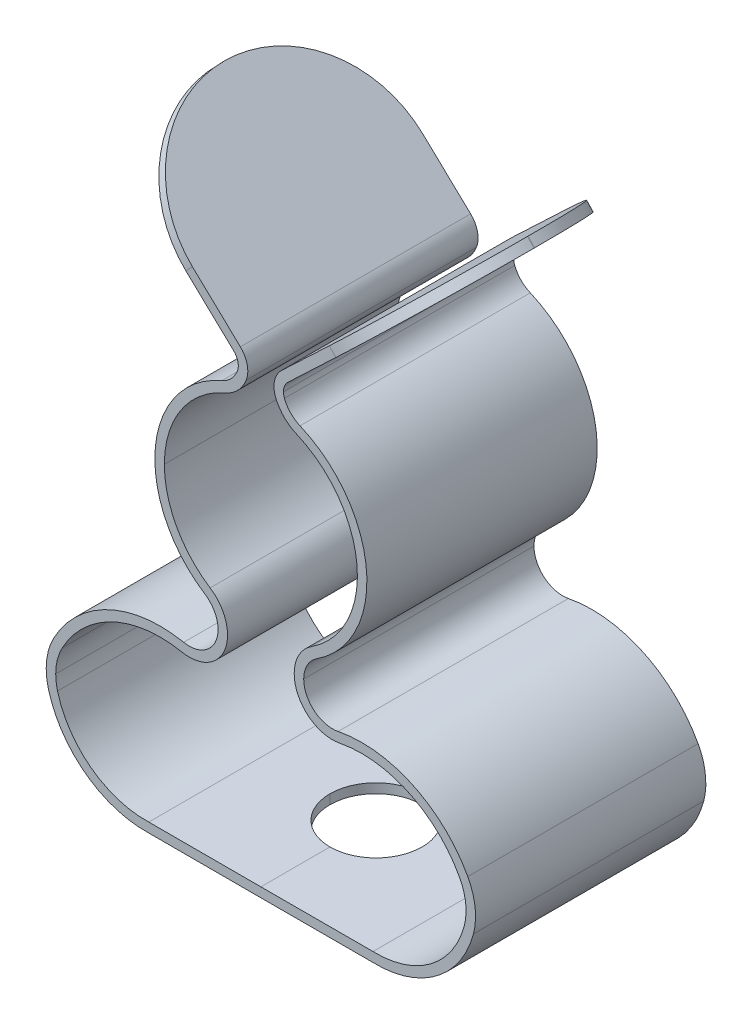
ISO-10303-21;
HEADER;
FILE_DESCRIPTION(('STEP AP214'),'2;1');
FILE_NAME('part.step','',(''),(''),'','','');
FILE_SCHEMA(('AUTOMOTIVE_DESIGN { 1 0 10303 214 1 1 1 1 }'));
ENDSEC;
DATA;
#1=APPLICATION_CONTEXT('core data for automotive mechanical design processes');
#2=APPLICATION_PROTOCOL_DEFINITION('international standard','automotive_design',2000,#1);
#3=PRODUCT_CONTEXT('',#1,'mechanical');
#4=PRODUCT('Part','Part','',(#3));
#5=PRODUCT_RELATED_PRODUCT_CATEGORY('part','',(#4));
#6=PRODUCT_DEFINITION_FORMATION('','',#4);
#7=PRODUCT_DEFINITION_CONTEXT('part definition',#1,'design');
#8=PRODUCT_DEFINITION('design','',#6,#7);
#9=PRODUCT_DEFINITION_SHAPE('','',#8);
#10=(LENGTH_UNIT() NAMED_UNIT(*) SI_UNIT(.MILLI.,.METRE.));
#11=(NAMED_UNIT(*) PLANE_ANGLE_UNIT() SI_UNIT($,.RADIAN.));
#12=(NAMED_UNIT(*) SI_UNIT($,.STERADIAN.) SOLID_ANGLE_UNIT());
#13=UNCERTAINTY_MEASURE_WITH_UNIT(LENGTH_MEASURE(1.E-05),#10,'distance_accuracy_value','');
#14=(GEOMETRIC_REPRESENTATION_CONTEXT(3) GLOBAL_UNCERTAINTY_ASSIGNED_CONTEXT((#13)) GLOBAL_UNIT_ASSIGNED_CONTEXT((#10,
#11,#12)) REPRESENTATION_CONTEXT('',''));
#15=CARTESIAN_POINT('',(0.,0.,0.));
#16=DIRECTION('',(0.,0.,1.));
#17=DIRECTION('',(1.,0.,0.));
#18=AXIS2_PLACEMENT_3D('',#15,#16,#17);
#19=CARTESIAN_POINT('',(0.000451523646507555,0.999999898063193,0.));
#20=DIRECTION('',(-0.00045152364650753,-0.999999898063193,0.));
#21=DIRECTION('',(0.999999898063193,-0.00045152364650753,0.));
#22=AXIS2_PLACEMENT_3D('',#19,#20,#21);
#23=CYLINDRICAL_SURFACE('',#22,1.6);
#24=DIRECTION('',(-0.000451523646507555,-0.999999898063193,0.));
#25=VECTOR('',#24,1.);
#26=CARTESIAN_POINT('',(-1.5995483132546,1.0007223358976,0.));
#27=LINE('',#26,#25);
#28=CARTESIAN_POINT('',(-1.59985083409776,0.330722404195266,0.));
#29=VERTEX_POINT('',#28);
#30=CARTESIAN_POINT('',(-1.59999983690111,0.000722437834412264,0.));
#31=VERTEX_POINT('',#30);
#32=EDGE_CURVE('E822',#29,#31,#27,.T.);
#33=ORIENTED_EDGE('',*,*,#32,.F.);
#34=CARTESIAN_POINT('',(0.000149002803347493,0.329999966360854,0.));
#35=DIRECTION('',(-0.000451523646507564,-0.999999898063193,0.));
#36=DIRECTION('',(0.999999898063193,-0.000451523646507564,0.));
#37=AXIS2_PLACEMENT_3D('',#34,#35,#36);
#38=CIRCLE('',#37,1.6);
#39=CARTESIAN_POINT('',(0.,0.33000003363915,1.59999999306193));
#40=VERTEX_POINT('',#39);
#41=EDGE_CURVE('E687',#40,#29,#38,.T.);
#42=ORIENTED_EDGE('',*,*,#41,.F.);
#43=CARTESIAN_POINT('',(1.60014949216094,0.330722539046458,0.));
#44=CARTESIAN_POINT('',(1.60014949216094,0.330722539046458,0.93732750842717));
#45=CARTESIAN_POINT('',(0.937327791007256,0.330423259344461,1.60008728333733));
#46=CARTESIAN_POINT('',(0.,0.33000003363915,1.59999999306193));
#47=(BOUNDED_CURVE() B_SPLINE_CURVE(3,(#43,#44,#45,#46),.UNSPECIFIED.,.F.,
.F.) B_SPLINE_CURVE_WITH_KNOTS((4,4),(3.1415926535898,4.71248210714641),
.UNSPECIFIED.) CURVE() GEOMETRIC_REPRESENTATION_ITEM() RATIONAL_B_SPLINE_CURVE((1.,
0.804715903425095,0.804715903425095,1.)) REPRESENTATION_ITEM(''));
#48=CARTESIAN_POINT('',(1.60014949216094,0.330722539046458,0.));
#49=VERTEX_POINT('',#48);
#50=EDGE_CURVE('E666',#49,#40,#47,.T.);
#51=ORIENTED_EDGE('',*,*,#50,.F.);
#52=DIRECTION('',(-0.000451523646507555,-0.999999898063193,0.));
#53=VECTOR('',#52,1.);
#54=CARTESIAN_POINT('',(1.60045136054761,0.999277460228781,0.));
#55=LINE('',#54,#53);
#56=CARTESIAN_POINT('',(1.60000048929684,0.000722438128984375,0.));
#57=VERTEX_POINT('',#56);
#58=EDGE_CURVE('E786',#49,#57,#55,.T.);
#59=ORIENTED_EDGE('',*,*,#58,.T.);
#60=CARTESIAN_POINT('',(1.60000048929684,0.000722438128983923,0.));
#61=CARTESIAN_POINT('',(1.60000103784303,0.000707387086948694,0.0261799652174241));
#62=CARTESIAN_POINT('',(1.599357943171,0.00069262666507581,0.0523598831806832));
#63=CARTESIAN_POINT('',(1.59678845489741,0.000663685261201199,0.104656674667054));
#64=CARTESIAN_POINT('',(1.59486206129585,0.000649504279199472,0.130773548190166));
#65=CARTESIAN_POINT('',(1.58972996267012,0.000621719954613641,0.182881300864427));
#66=CARTESIAN_POINT('',(1.58652425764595,0.000608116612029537,0.208872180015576));
#67=CARTESIAN_POINT('',(1.57884143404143,0.000581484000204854,0.260665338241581));
#68=CARTESIAN_POINT('',(1.57436431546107,0.000568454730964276,0.286467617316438));
#69=CARTESIAN_POINT('',(1.56414940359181,0.000542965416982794,0.337821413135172));
#70=CARTESIAN_POINT('',(1.5584116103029,0.000530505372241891,0.363372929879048));
#71=CARTESIAN_POINT('',(1.54568918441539,0.000506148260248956,0.414163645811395));
#72=CARTESIAN_POINT('',(1.5387045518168,0.000494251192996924,0.439402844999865));
#73=CARTESIAN_POINT('',(1.52350527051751,0.000471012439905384,0.489508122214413));
#74=CARTESIAN_POINT('',(1.51529062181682,0.000459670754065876,0.514374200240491));
#75=CARTESIAN_POINT('',(1.49765109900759,0.00043753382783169,0.563673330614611));
#76=CARTESIAN_POINT('',(1.48822622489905,0.000426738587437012,0.588106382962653));
#77=CARTESIAN_POINT('',(1.46818895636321,0.000405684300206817,0.636480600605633));
#78=CARTESIAN_POINT('',(1.45757656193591,0.0003954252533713,0.66042176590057));
#79=CARTESIAN_POINT('',(1.43518981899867,0.000375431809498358,0.707754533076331));
#80=CARTESIAN_POINT('',(1.42341547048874,0.000365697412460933,0.731146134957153));
#81=CARTESIAN_POINT('',(1.39873318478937,0.000346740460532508,0.777323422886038));
#82=CARTESIAN_POINT('',(1.38582524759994,0.000337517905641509,0.800109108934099));
#83=CARTESIAN_POINT('',(1.35890688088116,0.00031957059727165,0.845019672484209));
#84=CARTESIAN_POINT('',(1.3448964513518,0.000310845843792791,0.867144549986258));
#85=CARTESIAN_POINT('',(1.31580685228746,0.000293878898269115,0.910680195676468));
#86=CARTESIAN_POINT('',(1.30072768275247,0.000285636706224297,0.932090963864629));
#87=CARTESIAN_POINT('',(1.26953693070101,0.000269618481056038,0.974146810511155));
#88=CARTESIAN_POINT('',(1.25342534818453,0.000261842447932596,0.994791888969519));
#89=CARTESIAN_POINT('',(1.22020858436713,0.000246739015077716,1.03526662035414));
#90=CARTESIAN_POINT('',(1.2031034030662,0.000239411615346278,1.0550962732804));
#91=CARTESIAN_POINT('',(1.16794064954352,0.000225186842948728,1.09389238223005));
#92=CARTESIAN_POINT('',(1.14988307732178,0.000218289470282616,1.11285883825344));
#93=CARTESIAN_POINT('',(1.11285904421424,0.000204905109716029,1.14988286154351));
#94=CARTESIAN_POINT('',(1.09389258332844,0.000198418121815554,1.1679404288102));
#95=CARTESIAN_POINT('',(1.05509646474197,0.000185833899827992,1.20310317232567));
#96=CARTESIAN_POINT('',(1.03526680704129,0.000179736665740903,1.22020834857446));
#97=CARTESIAN_POINT('',(0.994792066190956,0.000167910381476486,1.2534251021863));
#98=CARTESIAN_POINT('',(0.974146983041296,0.000162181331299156,1.26953667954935));
#99=CARTESIAN_POINT('',(0.932091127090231,0.000151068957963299,1.30072742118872));
#100=CARTESIAN_POINT('',(0.910680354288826,0.000145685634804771,1.31580658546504));
#101=CARTESIAN_POINT('',(0.867144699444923,0.000135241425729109,1.3448961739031));
#102=CARTESIAN_POINT('',(0.845019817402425,0.000130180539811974,1.35890659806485));
#103=CARTESIAN_POINT('',(0.800109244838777,0.000120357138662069,1.38582495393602));
#104=CARTESIAN_POINT('',(0.777323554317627,0.000115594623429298,1.39873288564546));
#105=CARTESIAN_POINT('',(0.73114625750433,0.000106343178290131,1.42341516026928));
#106=CARTESIAN_POINT('',(0.707754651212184,0.000101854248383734,1.43518950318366));
#107=CARTESIAN_POINT('',(0.660421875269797,9.31245294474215E-05,1.45757623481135));
#108=CARTESIAN_POINT('',(0.636480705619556,8.88837404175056E-05,1.46818862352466));
#109=CARTESIAN_POINT('',(0.588106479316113,8.06242609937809E-05,1.48822588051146));
#110=CARTESIAN_POINT('',(0.563673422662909,7.66055705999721E-05,1.49765074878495));
#111=CARTESIAN_POINT('',(0.514374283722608,6.87637111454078E-05,1.51529025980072));
#112=CARTESIAN_POINT('',(0.489508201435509,6.49405420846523E-05,1.523504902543));
#113=CARTESIAN_POINT('',(0.439402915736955,5.74626769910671E-05,1.53870417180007));
#114=CARTESIAN_POINT('',(0.4141637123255,5.38079809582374E-05,1.54568879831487));
#115=CARTESIAN_POINT('',(0.363372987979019,4.6639607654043E-05,1.55841121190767));
#116=CARTESIAN_POINT('',(0.337821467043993,4.31259303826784E-05,1.56414899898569));
#117=CARTESIAN_POINT('',(0.286467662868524,3.62118009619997E-05,1.57436389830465));
#118=CARTESIAN_POINT('',(0.26066537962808,3.28113488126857E-05,1.5788410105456));
#119=CARTESIAN_POINT('',(0.208872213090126,2.60956019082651E-05,1.5865238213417));
#120=CARTESIAN_POINT('',(0.182881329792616,2.27803071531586E-05,1.58972951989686));
#121=CARTESIAN_POINT('',(0.130773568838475,1.62066070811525E-05,1.59486160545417));
#122=CARTESIAN_POINT('',(0.104656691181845,1.29482017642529E-05,1.59678799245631));
#123=CARTESIAN_POINT('',(0.0523598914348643,6.45985718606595E-06,1.59935746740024));
#124=CARTESIAN_POINT('',(0.0261799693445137,3.22991792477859E-06,1.60000055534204));
#125=CARTESIAN_POINT('',(0.,0.,1.6));
#126=B_SPLINE_CURVE_WITH_KNOTS('',3,(#60,#61,#62,#63,#64,#65,#66,#67,#68,#69,#70,#71,#72,#73,
#74,#75,#76,#77,#78,#79,#80,#81,#82,#83,#84,#85,#86,#87,#88,#89,#90,#91,#92,#93,#94,#95,#96,#97,
#98,#99,#100,#101,#102,#103,#104,#105,#106,#107,#108,#109,#110,#111,#112,#113,#114,#115,#116,
#117,#118,#119,#120,#121,#122,#123,#124,#125),.UNSPECIFIED.,.F.,.F.,(4,2,2,2,2,2,2,2,2,2,2,2,2,
2,2,2,2,2,2,2,2,2,2,2,2,2,2,2,2,2,2,2,4),(0.,0.078531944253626,0.157063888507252,
0.235595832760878,0.314127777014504,0.39265972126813,0.471191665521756,0.549723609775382,
0.628255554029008,0.706787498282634,0.78531944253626,0.863851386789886,0.942383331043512,
1.02091527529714,1.09944721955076,1.17797916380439,1.25651110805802,1.33504305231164,
1.41357499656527,1.49210694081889,1.57063888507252,1.64917082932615,1.72770277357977,
1.8062347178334,1.88476666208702,1.96329860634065,2.04183055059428,2.1203624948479,
2.19889443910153,2.27742638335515,2.35595832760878,2.4344902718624,2.51302221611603),.UNSPECIFIED.);
#127=CARTESIAN_POINT('',(0.,0.,1.6));
#128=VERTEX_POINT('',#127);
#129=EDGE_CURVE('E531',#57,#128,#126,.T.);
#130=ORIENTED_EDGE('',*,*,#129,.T.);
#131=CARTESIAN_POINT('',(0.,0.,0.));
#132=DIRECTION('',(-0.000451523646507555,-0.999999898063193,0.));
#133=DIRECTION('',(0.999999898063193,-0.000451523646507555,0.));
#134=AXIS2_PLACEMENT_3D('',#131,#132,#133);
#135=CIRCLE('',#134,1.6);
#136=EDGE_CURVE('E508',#128,#31,#135,.T.);
#137=ORIENTED_EDGE('',*,*,#136,.T.);
#138=EDGE_LOOP('',(#33,#42,#51,#59,#130,#137));
#139=FACE_BOUND('',#138,.T.);
#140=ADVANCED_FACE('F15',(#139),#23,.F.);
#141=CARTESIAN_POINT('',(-2.6033378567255,17.5560159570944,0.00999999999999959));
#142=DIRECTION('',(0.687715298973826,0.725980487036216,0.));
#143=DIRECTION('',(-0.725980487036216,0.687715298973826,0.));
#144=AXIS2_PLACEMENT_3D('',#141,#142,#143);
#145=CYLINDRICAL_SURFACE('',#144,3.99);
#146=CARTESIAN_POINT('',(-2.6033378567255,17.5560159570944,0.00999999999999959));
#147=DIRECTION('',(-0.687715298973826,-0.725980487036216,0.));
#148=DIRECTION('',(0.725980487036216,-0.687715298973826,0.));
#149=AXIS2_PLACEMENT_3D('',#146,#147,#148);
#150=CIRCLE('',#149,3.99);
#151=CARTESIAN_POINT('',(-2.6033378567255,17.5560159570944,4.));
#152=VERTEX_POINT('',#151);
#153=CARTESIAN_POINT('',(-5.5,20.3,0.00999999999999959));
#154=VERTEX_POINT('',#153);
#155=EDGE_CURVE('E439',#152,#154,#150,.T.);
#156=ORIENTED_EDGE('',*,*,#155,.F.);
#157=DIRECTION('',(-0.687715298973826,-0.725980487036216,0.));
#158=VECTOR('',#157,1.);
#159=CARTESIAN_POINT('',(-2.94719550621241,17.1930257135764,4.));
#160=LINE('',#159,#158);
#161=CARTESIAN_POINT('',(-2.37639180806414,17.7955895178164,4.));
#162=VERTEX_POINT('',#161);
#163=EDGE_CURVE('E761',#162,#152,#160,.T.);
#164=ORIENTED_EDGE('',*,*,#163,.F.);
#165=CARTESIAN_POINT('',(-2.37639180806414,17.7955895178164,0.00999999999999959));
#166=DIRECTION('',(0.687715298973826,0.725980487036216,0.));
#167=DIRECTION('',(0.725980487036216,-0.687715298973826,0.));
#168=AXIS2_PLACEMENT_3D('',#165,#166,#167);
#169=CIRCLE('',#168,3.99);
#170=CARTESIAN_POINT('',(-5.27305395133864,20.539573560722,0.00999999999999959));
#171=VERTEX_POINT('',#170);
#172=EDGE_CURVE('E1056',#171,#162,#169,.T.);
#173=ORIENTED_EDGE('',*,*,#172,.F.);
#174=DIRECTION('',(0.687715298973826,0.725980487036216,0.));
#175=VECTOR('',#174,1.);
#176=CARTESIAN_POINT('',(-5.5,20.3,0.00999999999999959));
#177=LINE('',#176,#175);
#178=EDGE_CURVE('E432',#154,#171,#177,.T.);
#179=ORIENTED_EDGE('',*,*,#178,.F.);
#180=EDGE_LOOP('',(#156,#164,#173,#179));
#181=FACE_BOUND('',#180,.T.);
#182=ADVANCED_FACE('F1193',(#181),#145,.T.);
#183=CARTESIAN_POINT('',(-2.94719550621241,17.1930257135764,-0.00999999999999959));
#184=DIRECTION('',(-0.687715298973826,-0.725980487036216,0.));
#185=DIRECTION('',(0.725980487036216,-0.687715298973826,0.));
#186=AXIS2_PLACEMENT_3D('',#183,#184,#185);
#187=CYLINDRICAL_SURFACE('',#186,3.99);
#188=CARTESIAN_POINT('',(-2.6033378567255,17.5560159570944,-0.00999999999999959));
#189=DIRECTION('',(-0.687715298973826,-0.725980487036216,0.));
#190=DIRECTION('',(0.725980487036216,-0.687715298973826,0.));
#191=AXIS2_PLACEMENT_3D('',#188,#189,#190);
#192=CIRCLE('',#191,3.99);
#193=CARTESIAN_POINT('',(-5.5,20.3,-0.00999999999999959));
#194=VERTEX_POINT('',#193);
#195=CARTESIAN_POINT('',(-2.6033378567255,17.5560159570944,-4.));
#196=VERTEX_POINT('',#195);
#197=EDGE_CURVE('E420',#194,#196,#192,.T.);
#198=ORIENTED_EDGE('',*,*,#197,.F.);
#199=DIRECTION('',(-0.687715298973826,-0.725980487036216,0.));
#200=VECTOR('',#199,1.);
#201=CARTESIAN_POINT('',(-5.5,20.3,-0.00999999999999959));
#202=LINE('',#201,#200);
#203=CARTESIAN_POINT('',(-5.27305395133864,20.539573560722,-0.00999999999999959));
#204=VERTEX_POINT('',#203);
#205=EDGE_CURVE('E425',#204,#194,#202,.T.);
#206=ORIENTED_EDGE('',*,*,#205,.F.);
#207=CARTESIAN_POINT('',(-2.37639180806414,17.7955895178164,-0.00999999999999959));
#208=DIRECTION('',(0.687715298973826,0.725980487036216,0.));
#209=DIRECTION('',(0.725980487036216,-0.687715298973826,0.));
#210=AXIS2_PLACEMENT_3D('',#207,#208,#209);
#211=CIRCLE('',#210,3.99);
#212=CARTESIAN_POINT('',(-2.37639180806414,17.7955895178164,-4.));
#213=VERTEX_POINT('',#212);
#214=EDGE_CURVE('E1051',#213,#204,#211,.T.);
#215=ORIENTED_EDGE('',*,*,#214,.F.);
#216=DIRECTION('',(0.687715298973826,0.725980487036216,0.));
#217=VECTOR('',#216,1.);
#218=CARTESIAN_POINT('',(-2.37639180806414,17.7955895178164,-4.));
#219=LINE('',#218,#217);
#220=EDGE_CURVE('E9',#196,#213,#219,.T.);
#221=ORIENTED_EDGE('',*,*,#220,.F.);
#222=EDGE_LOOP('',(#198,#206,#215,#221));
#223=FACE_BOUND('',#222,.T.);
#224=ADVANCED_FACE('F422',(#223),#187,.T.);
#225=CARTESIAN_POINT('',(2.37639180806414,17.7955895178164,0.00999999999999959));
#226=DIRECTION('',(0.687715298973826,-0.725980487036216,0.));
#227=DIRECTION('',(0.725980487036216,0.687715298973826,0.));
#228=AXIS2_PLACEMENT_3D('',#225,#226,#227);
#229=CYLINDRICAL_SURFACE('',#228,3.99);
#230=CARTESIAN_POINT('',(2.37639180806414,17.7955895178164,0.00999999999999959));
#231=DIRECTION('',(-0.687715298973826,0.725980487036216,0.));
#232=DIRECTION('',(0.725980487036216,0.687715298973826,0.));
#233=AXIS2_PLACEMENT_3D('',#230,#231,#232);
#234=CIRCLE('',#233,3.99);
#235=CARTESIAN_POINT('',(2.37639180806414,17.7955895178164,4.));
#236=VERTEX_POINT('',#235);
#237=CARTESIAN_POINT('',(5.27305395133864,20.539573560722,0.00999999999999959));
#238=VERTEX_POINT('',#237);
#239=EDGE_CURVE('E575',#236,#238,#234,.T.);
#240=ORIENTED_EDGE('',*,*,#239,.F.);
#241=DIRECTION('',(-0.687715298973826,0.725980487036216,0.));
#242=VECTOR('',#241,1.);
#243=CARTESIAN_POINT('',(1.73257541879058,18.47522851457,4.));
#244=LINE('',#243,#242);
#245=CARTESIAN_POINT('',(2.6033378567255,17.5560159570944,4.));
#246=VERTEX_POINT('',#245);
#247=EDGE_CURVE('E758',#246,#236,#244,.T.);
#248=ORIENTED_EDGE('',*,*,#247,.F.);
#249=CARTESIAN_POINT('',(2.6033378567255,17.5560159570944,0.00999999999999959));
#250=DIRECTION('',(0.687715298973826,-0.725980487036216,0.));
#251=DIRECTION('',(0.725980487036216,0.687715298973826,0.));
#252=AXIS2_PLACEMENT_3D('',#249,#250,#251);
#253=CIRCLE('',#252,3.99);
#254=CARTESIAN_POINT('',(5.5,20.3,0.00999999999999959));
#255=VERTEX_POINT('',#254);
#256=EDGE_CURVE('E613',#255,#246,#253,.T.);
#257=ORIENTED_EDGE('',*,*,#256,.F.);
#258=DIRECTION('',(0.687715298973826,-0.725980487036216,0.));
#259=VECTOR('',#258,1.);
#260=CARTESIAN_POINT('',(5.27305395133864,20.539573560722,0.00999999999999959));
#261=LINE('',#260,#259);
#262=EDGE_CURVE('E927',#238,#255,#261,.T.);
#263=ORIENTED_EDGE('',*,*,#262,.F.);
#264=EDGE_LOOP('',(#240,#248,#257,#263));
#265=FACE_BOUND('',#264,.T.);
#266=ADVANCED_FACE('F1106',(#265),#229,.T.);
#267=CARTESIAN_POINT('',(1.73257541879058,18.47522851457,-0.00999999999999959));
#268=DIRECTION('',(-0.687715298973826,0.725980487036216,0.));
#269=DIRECTION('',(-0.725980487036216,-0.687715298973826,0.));
#270=AXIS2_PLACEMENT_3D('',#267,#268,#269);
#271=CYLINDRICAL_SURFACE('',#270,3.99);
#272=CARTESIAN_POINT('',(2.37639180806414,17.7955895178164,-0.00999999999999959));
#273=DIRECTION('',(-0.687715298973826,0.725980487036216,0.));
#274=DIRECTION('',(0.725980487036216,0.687715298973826,0.));
#275=AXIS2_PLACEMENT_3D('',#272,#273,#274);
#276=CIRCLE('',#275,3.99);
#277=CARTESIAN_POINT('',(5.27305395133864,20.539573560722,-0.00999999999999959));
#278=VERTEX_POINT('',#277);
#279=CARTESIAN_POINT('',(2.37639180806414,17.7955895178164,-4.));
#280=VERTEX_POINT('',#279);
#281=EDGE_CURVE('E622',#278,#280,#276,.T.);
#282=ORIENTED_EDGE('',*,*,#281,.F.);
#283=DIRECTION('',(-0.687715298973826,0.725980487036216,0.));
#284=VECTOR('',#283,1.);
#285=CARTESIAN_POINT('',(5.27305395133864,20.539573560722,-0.00999999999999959));
#286=LINE('',#285,#284);
#287=CARTESIAN_POINT('',(5.5,20.3,-0.00999999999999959));
#288=VERTEX_POINT('',#287);
#289=EDGE_CURVE('E612',#288,#278,#286,.T.);
#290=ORIENTED_EDGE('',*,*,#289,.F.);
#291=CARTESIAN_POINT('',(2.6033378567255,17.5560159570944,-0.00999999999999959));
#292=DIRECTION('',(0.687715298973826,-0.725980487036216,0.));
#293=DIRECTION('',(0.725980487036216,0.687715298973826,0.));
#294=AXIS2_PLACEMENT_3D('',#291,#292,#293);
#295=CIRCLE('',#294,3.99);
#296=CARTESIAN_POINT('',(2.6033378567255,17.5560159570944,-4.));
#297=VERTEX_POINT('',#296);
#298=EDGE_CURVE('E865',#297,#288,#295,.T.);
#299=ORIENTED_EDGE('',*,*,#298,.F.);
#300=DIRECTION('',(0.687715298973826,-0.725980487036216,0.));
#301=VECTOR('',#300,1.);
#302=CARTESIAN_POINT('',(2.6033378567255,17.5560159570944,-4.));
#303=LINE('',#302,#301);
#304=EDGE_CURVE('E26',#280,#297,#303,.T.);
#305=ORIENTED_EDGE('',*,*,#304,.F.);
#306=EDGE_LOOP('',(#282,#290,#299,#305));
#307=FACE_BOUND('',#306,.T.);
#308=ADVANCED_FACE('F1102',(#307),#271,.T.);
#309=CARTESIAN_POINT('',(-1.28408298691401,15.6175730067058,-4.));
#310=DIRECTION('',(0.,0.,1.));
#311=DIRECTION('',(1.,0.,0.));
#312=AXIS2_PLACEMENT_3D('',#309,#310,#311);
#313=PLANE('',#312);
#314=DIRECTION('',(-0.725980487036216,-0.687715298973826,0.));
#315=VECTOR('',#314,1.);
#316=CARTESIAN_POINT('',(5.27305395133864,20.539573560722,-4.));
#317=LINE('',#316,#315);
#318=CARTESIAN_POINT('',(0.713279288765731,16.2201368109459,-4.));
#319=VERTEX_POINT('',#318);
#320=EDGE_CURVE('E618',#280,#319,#317,.T.);
#321=ORIENTED_EDGE('',*,*,#320,.F.);
#322=ORIENTED_EDGE('',*,*,#304,.T.);
#323=DIRECTION('',(-0.725980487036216,-0.687715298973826,0.));
#324=VECTOR('',#323,1.);
#325=CARTESIAN_POINT('',(5.5,20.3,-4.));
#326=LINE('',#325,#324);
#327=CARTESIAN_POINT('',(0.940225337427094,15.9805632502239,-4.));
#328=VERTEX_POINT('',#327);
#329=EDGE_CURVE('E608',#297,#328,#326,.T.);
#330=ORIENTED_EDGE('',*,*,#329,.T.);
#331=CARTESIAN_POINT('',(1.28408298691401,15.6175730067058,-4.));
#332=DIRECTION('',(0.,0.,1.));
#333=DIRECTION('',(1.,0.,0.));
#334=AXIS2_PLACEMENT_3D('',#331,#332,#333);
#335=CIRCLE('',#334,0.5);
#336=CARTESIAN_POINT('',(0.784082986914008,15.6175730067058,-4.));
#337=VERTEX_POINT('',#336);
#338=EDGE_CURVE('E962',#328,#337,#335,.T.);
#339=ORIENTED_EDGE('',*,*,#338,.T.);
#340=CARTESIAN_POINT('',(1.28408298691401,15.6175730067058,-4.));
#341=DIRECTION('',(0.,0.,1.));
#342=DIRECTION('',(1.,0.,0.));
#343=AXIS2_PLACEMENT_3D('',#340,#341,#342);
#344=CIRCLE('',#343,0.5);
#345=CARTESIAN_POINT('',(0.818550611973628,15.4351460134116,-4.));
#346=VERTEX_POINT('',#345);
#347=EDGE_CURVE('E605',#337,#346,#344,.T.);
#348=ORIENTED_EDGE('',*,*,#347,.T.);
#349=CARTESIAN_POINT('',(1.74961536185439,15.8,-4.));
#350=DIRECTION('',(0.,0.,1.));
#351=DIRECTION('',(-1.,0.,0.));
#352=AXIS2_PLACEMENT_3D('',#349,#350,#351);
#353=CIRCLE('',#352,1.);
#354=CARTESIAN_POINT('',(1.35879882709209,14.8795314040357,-4.));
#355=VERTEX_POINT('',#354);
#356=EDGE_CURVE('E593',#346,#355,#353,.T.);
#357=ORIENTED_EDGE('',*,*,#356,.T.);
#358=CARTESIAN_POINT('',(-0.132414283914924,11.3673595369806,-4.));
#359=DIRECTION('',(0.,0.,-1.));
#360=DIRECTION('',(-1.,0.,0.));
#361=AXIS2_PLACEMENT_3D('',#358,#359,#360);
#362=CIRCLE('',#361,3.81563464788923);
#363=CARTESIAN_POINT('',(1.94329406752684,8.16571892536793,-4.));
#364=VERTEX_POINT('',#363);
#365=EDGE_CURVE('E580',#355,#364,#362,.T.);
#366=ORIENTED_EDGE('',*,*,#365,.T.);
#367=CARTESIAN_POINT('',(2.48729488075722,7.3266342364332,-4.));
#368=DIRECTION('',(0.,0.,1.));
#369=DIRECTION('',(1.,0.,0.));
#370=AXIS2_PLACEMENT_3D('',#367,#368,#369);
#371=CIRCLE('',#370,1.);
#372=CARTESIAN_POINT('',(1.48729488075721,7.3266342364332,-4.));
#373=VERTEX_POINT('',#372);
#374=EDGE_CURVE('E978',#364,#373,#371,.T.);
#375=ORIENTED_EDGE('',*,*,#374,.T.);
#376=CARTESIAN_POINT('',(2.48729488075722,7.3266342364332,-4.));
#377=DIRECTION('',(0.,0.,1.));
#378=DIRECTION('',(1.,0.,0.));
#379=AXIS2_PLACEMENT_3D('',#376,#377,#378);
#380=CIRCLE('',#379,1.);
#381=CARTESIAN_POINT('',(2.68206758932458,6.34578583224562,-4.));
#382=VERTEX_POINT('',#381);
#383=EDGE_CURVE('E577',#373,#382,#380,.T.);
#384=ORIENTED_EDGE('',*,*,#383,.T.);
#385=CARTESIAN_POINT('',(3.49963265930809,2.22864128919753,-4.));
#386=DIRECTION('',(0.,0.,-1.));
#387=DIRECTION('',(1.,0.,0.));
#388=AXIS2_PLACEMENT_3D('',#385,#386,#387);
#389=CIRCLE('',#388,4.19753401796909);
#390=CARTESIAN_POINT('',(7.18821404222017,4.23205318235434,-4.));
#391=VERTEX_POINT('',#390);
#392=EDGE_CURVE('E555',#382,#391,#389,.T.);
#393=ORIENTED_EDGE('',*,*,#392,.T.);
#394=CARTESIAN_POINT('',(5.23738990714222,3.17248478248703,-4.));
#395=DIRECTION('',(0.,0.,-1.));
#396=DIRECTION('',(-1.,0.,0.));
#397=AXIS2_PLACEMENT_3D('',#394,#395,#396);
#398=CIRCLE('',#397,2.22);
#399=CARTESIAN_POINT('',(7.38348802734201,2.60445057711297,-4.));
#400=VERTEX_POINT('',#399);
#401=EDGE_CURVE('E547',#391,#400,#398,.T.);
#402=ORIENTED_EDGE('',*,*,#401,.T.);
#403=CARTESIAN_POINT('',(4.,3.5,-4.));
#404=DIRECTION('',(0.,0.,-1.));
#405=DIRECTION('',(1.,0.,0.));
#406=AXIS2_PLACEMENT_3D('',#403,#404,#405);
#407=CIRCLE('',#406,3.5);
#408=CARTESIAN_POINT('',(3.88914334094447,0.00175604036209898,-4.));
#409=VERTEX_POINT('',#408);
#410=EDGE_CURVE('E532',#400,#409,#407,.T.);
#411=ORIENTED_EDGE('',*,*,#410,.T.);
#412=DIRECTION('',(-0.999999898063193,-0.000451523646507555,0.));
#413=VECTOR('',#412,1.);
#414=CARTESIAN_POINT('',(3.88914334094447,0.00175604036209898,-4.));
#415=LINE('',#414,#413);
#416=CARTESIAN_POINT('',(0.,0.,-4.));
#417=VERTEX_POINT('',#416);
#418=EDGE_CURVE('E516',#409,#417,#415,.T.);
#419=ORIENTED_EDGE('',*,*,#418,.T.);
#420=DIRECTION('',(-0.999999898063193,0.000451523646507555,0.));
#421=VECTOR('',#420,1.);
#422=CARTESIAN_POINT('',(-3.88914334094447,0.00175604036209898,-4.));
#423=LINE('',#422,#421);
#424=CARTESIAN_POINT('',(-3.88914334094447,0.00175604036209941,-4.));
#425=VERTEX_POINT('',#424);
#426=EDGE_CURVE('E510',#417,#425,#423,.T.);
#427=ORIENTED_EDGE('',*,*,#426,.T.);
#428=CARTESIAN_POINT('',(-4.,3.5,-4.));
#429=DIRECTION('',(0.,0.,-1.));
#430=DIRECTION('',(-1.,0.,0.));
#431=AXIS2_PLACEMENT_3D('',#428,#429,#430);
#432=CIRCLE('',#431,3.5);
#433=CARTESIAN_POINT('',(-7.38348802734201,2.60445057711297,-4.));
#434=VERTEX_POINT('',#433);
#435=EDGE_CURVE('E504',#425,#434,#432,.T.);
#436=ORIENTED_EDGE('',*,*,#435,.T.);
#437=CARTESIAN_POINT('',(-5.23738990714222,3.17248478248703,-4.));
#438=DIRECTION('',(0.,0.,-1.));
#439=DIRECTION('',(1.,0.,0.));
#440=AXIS2_PLACEMENT_3D('',#437,#438,#439);
#441=CIRCLE('',#440,2.22);
#442=CARTESIAN_POINT('',(-7.45738990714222,3.17248478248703,-4.));
#443=VERTEX_POINT('',#442);
#444=EDGE_CURVE('E1006',#434,#443,#441,.T.);
#445=ORIENTED_EDGE('',*,*,#444,.T.);
#446=CARTESIAN_POINT('',(-5.23738990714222,3.17248478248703,-4.));
#447=DIRECTION('',(0.,0.,-1.));
#448=DIRECTION('',(1.,0.,0.));
#449=AXIS2_PLACEMENT_3D('',#446,#447,#448);
#450=CIRCLE('',#449,2.22);
#451=CARTESIAN_POINT('',(-7.18821404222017,4.23205318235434,-4.));
#452=VERTEX_POINT('',#451);
#453=EDGE_CURVE('E500',#443,#452,#450,.T.);
#454=ORIENTED_EDGE('',*,*,#453,.T.);
#455=CARTESIAN_POINT('',(-3.49963265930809,2.22864128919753,-4.));
#456=DIRECTION('',(0.,0.,-1.));
#457=DIRECTION('',(-1.,0.,0.));
#458=AXIS2_PLACEMENT_3D('',#455,#456,#457);
#459=CIRCLE('',#458,4.19753401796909);
#460=CARTESIAN_POINT('',(-2.68206758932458,6.34578583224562,-4.));
#461=VERTEX_POINT('',#460);
#462=EDGE_CURVE('E491',#452,#461,#459,.T.);
#463=ORIENTED_EDGE('',*,*,#462,.T.);
#464=CARTESIAN_POINT('',(-2.48729488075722,7.3266342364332,-4.));
#465=DIRECTION('',(0.,0.,1.));
#466=DIRECTION('',(-1.,0.,0.));
#467=AXIS2_PLACEMENT_3D('',#464,#465,#466);
#468=CIRCLE('',#467,1.);
#469=CARTESIAN_POINT('',(-1.94329406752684,8.16571892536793,-4.));
#470=VERTEX_POINT('',#469);
#471=EDGE_CURVE('E490',#461,#470,#468,.T.);
#472=ORIENTED_EDGE('',*,*,#471,.T.);
#473=CARTESIAN_POINT('',(0.132414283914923,11.3673595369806,-4.));
#474=DIRECTION('',(0.,0.,-1.));
#475=DIRECTION('',(1.,0.,0.));
#476=AXIS2_PLACEMENT_3D('',#473,#474,#475);
#477=CIRCLE('',#476,3.81563464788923);
#478=CARTESIAN_POINT('',(-3.6832203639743,11.3673595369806,-4.));
#479=VERTEX_POINT('',#478);
#480=EDGE_CURVE('E1033',#470,#479,#477,.T.);
#481=ORIENTED_EDGE('',*,*,#480,.T.);
#482=CARTESIAN_POINT('',(0.132414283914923,11.3673595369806,-4.));
#483=DIRECTION('',(0.,0.,-1.));
#484=DIRECTION('',(1.,0.,0.));
#485=AXIS2_PLACEMENT_3D('',#482,#483,#484);
#486=CIRCLE('',#485,3.81563464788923);
#487=CARTESIAN_POINT('',(-1.35879882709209,14.8795314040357,-4.));
#488=VERTEX_POINT('',#487);
#489=EDGE_CURVE('E487',#479,#488,#486,.T.);
#490=ORIENTED_EDGE('',*,*,#489,.T.);
#491=CARTESIAN_POINT('',(-1.74961536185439,15.8,-4.));
#492=DIRECTION('',(0.,0.,1.));
#493=DIRECTION('',(1.,0.,0.));
#494=AXIS2_PLACEMENT_3D('',#491,#492,#493);
#495=CIRCLE('',#494,1.);
#496=CARTESIAN_POINT('',(-0.818550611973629,15.4351460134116,-4.));
#497=VERTEX_POINT('',#496);
#498=EDGE_CURVE('E479',#488,#497,#495,.T.);
#499=ORIENTED_EDGE('',*,*,#498,.T.);
#500=CARTESIAN_POINT('',(-1.28408298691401,15.6175730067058,-4.));
#501=DIRECTION('',(0.,0.,1.));
#502=DIRECTION('',(-1.,0.,0.));
#503=AXIS2_PLACEMENT_3D('',#500,#501,#502);
#504=CIRCLE('',#503,0.5);
#505=CARTESIAN_POINT('',(-0.940225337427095,15.9805632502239,-4.));
#506=VERTEX_POINT('',#505);
#507=EDGE_CURVE('E471',#497,#506,#504,.T.);
#508=ORIENTED_EDGE('',*,*,#507,.T.);
#509=DIRECTION('',(-0.725980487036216,0.687715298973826,0.));
#510=VECTOR('',#509,1.);
#511=CARTESIAN_POINT('',(-5.5,20.3,-4.));
#512=LINE('',#511,#510);
#513=EDGE_CURVE('E431',#506,#196,#512,.T.);
#514=ORIENTED_EDGE('',*,*,#513,.T.);
#515=ORIENTED_EDGE('',*,*,#220,.T.);
#516=DIRECTION('',(-0.725980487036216,0.687715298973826,0.));
#517=VECTOR('',#516,1.);
#518=CARTESIAN_POINT('',(-5.27305395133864,20.539573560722,-4.));
#519=LINE('',#518,#517);
#520=CARTESIAN_POINT('',(-0.713279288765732,16.2201368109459,-4.));
#521=VERTEX_POINT('',#520);
#522=EDGE_CURVE('E1041',#521,#213,#519,.T.);
#523=ORIENTED_EDGE('',*,*,#522,.F.);
#524=CARTESIAN_POINT('',(-1.28408298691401,15.6175730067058,-4.));
#525=DIRECTION('',(0.,0.,1.));
#526=DIRECTION('',(1.,0.,0.));
#527=AXIS2_PLACEMENT_3D('',#524,#525,#526);
#528=CIRCLE('',#527,0.83);
#529=CARTESIAN_POINT('',(-0.511299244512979,15.3147441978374,-4.));
#530=VERTEX_POINT('',#529);
#531=EDGE_CURVE('E753',#530,#521,#528,.T.);
#532=ORIENTED_EDGE('',*,*,#531,.F.);
#533=CARTESIAN_POINT('',(-1.74961536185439,15.8,-4.));
#534=DIRECTION('',(0.,0.,1.));
#535=DIRECTION('',(1.,0.,0.));
#536=AXIS2_PLACEMENT_3D('',#533,#534,#535);
#537=CIRCLE('',#536,1.33);
#538=CARTESIAN_POINT('',(-1.22982937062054,14.5757767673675,-4.));
#539=VERTEX_POINT('',#538);
#540=EDGE_CURVE('E745',#539,#530,#537,.T.);
#541=ORIENTED_EDGE('',*,*,#540,.F.);
#542=CARTESIAN_POINT('',(0.132414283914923,11.3673595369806,-4.));
#543=DIRECTION('',(0.,0.,-1.));
#544=DIRECTION('',(1.,0.,0.));
#545=AXIS2_PLACEMENT_3D('',#542,#543,#544);
#546=CIRCLE('',#545,3.48563464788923);
#547=CARTESIAN_POINT('',(-3.3532203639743,11.3673595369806,-4.));
#548=VERTEX_POINT('',#547);
#549=EDGE_CURVE('E884',#548,#539,#546,.T.);
#550=ORIENTED_EDGE('',*,*,#549,.F.);
#551=CARTESIAN_POINT('',(0.132414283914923,11.3673595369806,-4.));
#552=DIRECTION('',(0.,0.,-1.));
#553=DIRECTION('',(1.,0.,0.));
#554=AXIS2_PLACEMENT_3D('',#551,#552,#553);
#555=CIRCLE('',#554,3.48563464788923);
#556=CARTESIAN_POINT('',(-1.76377379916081,8.44261687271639,-4.));
#557=VERTEX_POINT('',#556);
#558=EDGE_CURVE('E741',#557,#548,#555,.T.);
#559=ORIENTED_EDGE('',*,*,#558,.F.);
#560=CARTESIAN_POINT('',(-2.48729488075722,7.3266342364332,-4.));
#561=DIRECTION('',(0.,0.,1.));
#562=DIRECTION('',(1.,0.,0.));
#563=AXIS2_PLACEMENT_3D('',#560,#561,#562);
#564=CIRCLE('',#563,1.33);
#565=CARTESIAN_POINT('',(-2.74634258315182,6.02210585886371,-4.));
#566=VERTEX_POINT('',#565);
#567=EDGE_CURVE('E247',#566,#557,#564,.T.);
#568=ORIENTED_EDGE('',*,*,#567,.F.);
#569=CARTESIAN_POINT('',(-3.49963265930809,2.22864128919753,-4.));
#570=DIRECTION('',(0.,0.,-1.));
#571=DIRECTION('',(1.,0.,0.));
#572=AXIS2_PLACEMENT_3D('',#569,#570,#571);
#573=CIRCLE('',#572,3.8675340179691);
#574=CARTESIAN_POINT('',(-6.89822667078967,4.07454977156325,-4.));
#575=VERTEX_POINT('',#574);
#576=EDGE_CURVE('E719',#575,#566,#573,.T.);
#577=ORIENTED_EDGE('',*,*,#576,.F.);
#578=CARTESIAN_POINT('',(-5.23738990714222,3.17248478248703,-4.));
#579=DIRECTION('',(0.,0.,-1.));
#580=DIRECTION('',(1.,0.,0.));
#581=AXIS2_PLACEMENT_3D('',#578,#579,#580);
#582=CIRCLE('',#581,1.89);
#583=CARTESIAN_POINT('',(-7.12738990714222,3.17248478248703,-4.));
#584=VERTEX_POINT('',#583);
#585=EDGE_CURVE('E857',#584,#575,#582,.T.);
#586=ORIENTED_EDGE('',*,*,#585,.F.);
#587=CARTESIAN_POINT('',(-5.23738990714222,3.17248478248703,-4.));
#588=DIRECTION('',(0.,0.,-1.));
#589=DIRECTION('',(1.,0.,0.));
#590=AXIS2_PLACEMENT_3D('',#587,#588,#589);
#591=CIRCLE('',#590,1.89);
#592=CARTESIAN_POINT('',(-7.06447344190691,2.68888809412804,-4.));
#593=VERTEX_POINT('',#592);
#594=EDGE_CURVE('E715',#593,#584,#591,.T.);
#595=ORIENTED_EDGE('',*,*,#594,.F.);
#596=CARTESIAN_POINT('',(-4.,3.5,-4.));
#597=DIRECTION('',(0.,0.,-1.));
#598=DIRECTION('',(1.,0.,0.));
#599=AXIS2_PLACEMENT_3D('',#596,#597,#598);
#600=CIRCLE('',#599,3.17);
#601=CARTESIAN_POINT('',(-3.89442754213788,0.331758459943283,-4.));
#602=VERTEX_POINT('',#601);
#603=EDGE_CURVE('E700',#602,#593,#600,.T.);
#604=ORIENTED_EDGE('',*,*,#603,.F.);
#605=DIRECTION('',(-0.999999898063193,0.000451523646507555,0.));
#606=VECTOR('',#605,1.);
#607=CARTESIAN_POINT('',(-3.88899433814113,0.331756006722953,-4.));
#608=LINE('',#607,#606);
#609=CARTESIAN_POINT('',(0.,0.33000003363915,-4.));
#610=VERTEX_POINT('',#609);
#611=EDGE_CURVE('E691',#610,#602,#608,.T.);
#612=ORIENTED_EDGE('',*,*,#611,.F.);
#613=DIRECTION('',(-0.999999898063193,-0.000451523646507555,0.));
#614=VECTOR('',#613,1.);
#615=CARTESIAN_POINT('',(3.88899433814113,0.331756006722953,-4.));
#616=LINE('',#615,#614);
#617=CARTESIAN_POINT('',(3.89442754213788,0.331758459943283,-4.));
#618=VERTEX_POINT('',#617);
#619=EDGE_CURVE('E683',#618,#610,#616,.T.);
#620=ORIENTED_EDGE('',*,*,#619,.F.);
#621=CARTESIAN_POINT('',(4.,3.5,-4.));
#622=DIRECTION('',(0.,0.,-1.));
#623=DIRECTION('',(1.,0.,0.));
#624=AXIS2_PLACEMENT_3D('',#621,#622,#623);
#625=CIRCLE('',#624,3.17);
#626=CARTESIAN_POINT('',(7.06447344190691,2.68888809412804,-4.));
#627=VERTEX_POINT('',#626);
#628=EDGE_CURVE('E650',#627,#618,#625,.T.);
#629=ORIENTED_EDGE('',*,*,#628,.F.);
#630=CARTESIAN_POINT('',(5.23738990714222,3.17248478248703,-4.));
#631=DIRECTION('',(0.,0.,-1.));
#632=DIRECTION('',(1.,0.,0.));
#633=AXIS2_PLACEMENT_3D('',#630,#631,#632);
#634=CIRCLE('',#633,1.89);
#635=CARTESIAN_POINT('',(6.89822667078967,4.07454977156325,-4.));
#636=VERTEX_POINT('',#635);
#637=EDGE_CURVE('E638',#636,#627,#634,.T.);
#638=ORIENTED_EDGE('',*,*,#637,.F.);
#639=CARTESIAN_POINT('',(3.49963265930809,2.22864128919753,-4.));
#640=DIRECTION('',(0.,0.,-1.));
#641=DIRECTION('',(1.,0.,0.));
#642=AXIS2_PLACEMENT_3D('',#639,#640,#641);
#643=CIRCLE('',#642,3.8675340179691);
#644=CARTESIAN_POINT('',(2.74634258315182,6.02210585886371,-4.));
#645=VERTEX_POINT('',#644);
#646=EDGE_CURVE('E527',#645,#636,#643,.T.);
#647=ORIENTED_EDGE('',*,*,#646,.F.);
#648=CARTESIAN_POINT('',(2.48729488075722,7.3266342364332,-4.));
#649=DIRECTION('',(0.,0.,1.));
#650=DIRECTION('',(1.,0.,0.));
#651=AXIS2_PLACEMENT_3D('',#648,#649,#650);
#652=CIRCLE('',#651,1.33);
#653=CARTESIAN_POINT('',(1.15729488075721,7.3266342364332,-4.));
#654=VERTEX_POINT('',#653);
#655=EDGE_CURVE('E892',#654,#645,#652,.T.);
#656=ORIENTED_EDGE('',*,*,#655,.F.);
#657=CARTESIAN_POINT('',(2.48729488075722,7.3266342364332,-4.));
#658=DIRECTION('',(0.,0.,1.));
#659=DIRECTION('',(1.,0.,0.));
#660=AXIS2_PLACEMENT_3D('',#657,#658,#659);
#661=CIRCLE('',#660,1.33);
#662=CARTESIAN_POINT('',(1.76377379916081,8.44261687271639,-4.));
#663=VERTEX_POINT('',#662);
#664=EDGE_CURVE('E524',#663,#654,#661,.T.);
#665=ORIENTED_EDGE('',*,*,#664,.F.);
#666=CARTESIAN_POINT('',(-0.132414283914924,11.3673595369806,-4.));
#667=DIRECTION('',(0.,0.,-1.));
#668=DIRECTION('',(1.,0.,0.));
#669=AXIS2_PLACEMENT_3D('',#666,#667,#668);
#670=CIRCLE('',#669,3.48563464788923);
#671=CARTESIAN_POINT('',(1.22982937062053,14.5757767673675,-4.));
#672=VERTEX_POINT('',#671);
#673=EDGE_CURVE('E536',#672,#663,#670,.T.);
#674=ORIENTED_EDGE('',*,*,#673,.F.);
#675=CARTESIAN_POINT('',(1.74961536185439,15.8,-4.));
#676=DIRECTION('',(0.,0.,1.));
#677=DIRECTION('',(1.,0.,0.));
#678=AXIS2_PLACEMENT_3D('',#675,#676,#677);
#679=CIRCLE('',#678,1.33);
#680=CARTESIAN_POINT('',(0.511299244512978,15.3147441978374,-4.));
#681=VERTEX_POINT('',#680);
#682=EDGE_CURVE('E562',#681,#672,#679,.T.);
#683=ORIENTED_EDGE('',*,*,#682,.F.);
#684=CARTESIAN_POINT('',(1.28408298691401,15.6175730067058,-4.));
#685=DIRECTION('',(0.,0.,1.));
#686=DIRECTION('',(1.,0.,0.));
#687=AXIS2_PLACEMENT_3D('',#684,#685,#686);
#688=CIRCLE('',#687,0.83);
#689=CARTESIAN_POINT('',(0.454082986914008,15.6175730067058,-4.));
#690=VERTEX_POINT('',#689);
#691=EDGE_CURVE('E938',#690,#681,#688,.T.);
#692=ORIENTED_EDGE('',*,*,#691,.F.);
#693=CARTESIAN_POINT('',(1.28408298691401,15.6175730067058,-4.));
#694=DIRECTION('',(0.,0.,1.));
#695=DIRECTION('',(1.,0.,0.));
#696=AXIS2_PLACEMENT_3D('',#693,#694,#695);
#697=CIRCLE('',#696,0.83);
#698=EDGE_CURVE('E559',#319,#690,#697,.T.);
#699=ORIENTED_EDGE('',*,*,#698,.F.);
#700=EDGE_LOOP('',(#321,#322,#330,#339,#348,#357,#366,#375,#384,#393,#402,#411,#419,#427,#436,
#445,#454,#463,#472,#481,#490,#499,#508,#514,#515,#523,#532,#541,#550,#559,#568,#577,#586,#595,
#604,#612,#620,#629,#638,#647,#656,#665,#674,#683,#692,#699));
#701=FACE_BOUND('',#700,.T.);
#702=ADVANCED_FACE('F1105',(#701),#313,.F.);
#703=CARTESIAN_POINT('',(-1.28408298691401,15.6175730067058,4.));
#704=DIRECTION('',(0.,0.,1.));
#705=DIRECTION('',(1.,0.,0.));
#706=AXIS2_PLACEMENT_3D('',#703,#704,#705);
#707=PLANE('',#706);
#708=DIRECTION('',(-0.725980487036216,-0.687715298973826,0.));
#709=VECTOR('',#708,1.);
#710=CARTESIAN_POINT('',(5.5,20.3,4.));
#711=LINE('',#710,#709);
#712=CARTESIAN_POINT('',(0.940225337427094,15.9805632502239,4.));
#713=VERTEX_POINT('',#712);
#714=EDGE_CURVE('E609',#246,#713,#711,.T.);
#715=ORIENTED_EDGE('',*,*,#714,.F.);
#716=ORIENTED_EDGE('',*,*,#247,.T.);
#717=DIRECTION('',(-0.725980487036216,-0.687715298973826,0.));
#718=VECTOR('',#717,1.);
#719=CARTESIAN_POINT('',(5.27305395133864,20.539573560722,4.));
#720=LINE('',#719,#718);
#721=CARTESIAN_POINT('',(0.713279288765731,16.2201368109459,4.));
#722=VERTEX_POINT('',#721);
#723=EDGE_CURVE('E571',#236,#722,#720,.T.);
#724=ORIENTED_EDGE('',*,*,#723,.T.);
#725=CARTESIAN_POINT('',(1.28408298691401,15.6175730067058,4.));
#726=DIRECTION('',(0.,0.,1.));
#727=DIRECTION('',(1.,0.,0.));
#728=AXIS2_PLACEMENT_3D('',#725,#726,#727);
#729=CIRCLE('',#728,0.83);
#730=CARTESIAN_POINT('',(0.454082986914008,15.6175730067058,4.));
#731=VERTEX_POINT('',#730);
#732=EDGE_CURVE('E563',#722,#731,#729,.T.);
#733=ORIENTED_EDGE('',*,*,#732,.T.);
#734=CARTESIAN_POINT('',(1.28408298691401,15.6175730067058,4.));
#735=DIRECTION('',(0.,0.,1.));
#736=DIRECTION('',(1.,0.,0.));
#737=AXIS2_PLACEMENT_3D('',#734,#735,#736);
#738=CIRCLE('',#737,0.83);
#739=CARTESIAN_POINT('',(0.511299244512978,15.3147441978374,4.));
#740=VERTEX_POINT('',#739);
#741=EDGE_CURVE('E924',#731,#740,#738,.T.);
#742=ORIENTED_EDGE('',*,*,#741,.T.);
#743=CARTESIAN_POINT('',(1.74961536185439,15.8,4.));
#744=DIRECTION('',(0.,0.,1.));
#745=DIRECTION('',(1.,0.,0.));
#746=AXIS2_PLACEMENT_3D('',#743,#744,#745);
#747=CIRCLE('',#746,1.33);
#748=CARTESIAN_POINT('',(1.22982937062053,14.5757767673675,4.));
#749=VERTEX_POINT('',#748);
#750=EDGE_CURVE('E541',#740,#749,#747,.T.);
#751=ORIENTED_EDGE('',*,*,#750,.T.);
#752=CARTESIAN_POINT('',(-0.132414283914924,11.3673595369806,4.));
#753=DIRECTION('',(0.,0.,-1.));
#754=DIRECTION('',(1.,0.,0.));
#755=AXIS2_PLACEMENT_3D('',#752,#753,#754);
#756=CIRCLE('',#755,3.48563464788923);
#757=CARTESIAN_POINT('',(1.76377379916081,8.44261687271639,4.));
#758=VERTEX_POINT('',#757);
#759=EDGE_CURVE('E597',#749,#758,#756,.T.);
#760=ORIENTED_EDGE('',*,*,#759,.T.);
#761=CARTESIAN_POINT('',(2.48729488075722,7.3266342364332,4.));
#762=DIRECTION('',(0.,0.,1.));
#763=DIRECTION('',(1.,0.,0.));
#764=AXIS2_PLACEMENT_3D('',#761,#762,#763);
#765=CIRCLE('',#764,1.33);
#766=CARTESIAN_POINT('',(1.15729488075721,7.3266342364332,4.));
#767=VERTEX_POINT('',#766);
#768=EDGE_CURVE('E528',#758,#767,#765,.T.);
#769=ORIENTED_EDGE('',*,*,#768,.T.);
#770=CARTESIAN_POINT('',(2.48729488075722,7.3266342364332,4.));
#771=DIRECTION('',(0.,0.,1.));
#772=DIRECTION('',(1.,0.,0.));
#773=AXIS2_PLACEMENT_3D('',#770,#771,#772);
#774=CIRCLE('',#773,1.33);
#775=CARTESIAN_POINT('',(2.74634258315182,6.02210585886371,4.));
#776=VERTEX_POINT('',#775);
#777=EDGE_CURVE('E856',#767,#776,#774,.T.);
#778=ORIENTED_EDGE('',*,*,#777,.T.);
#779=CARTESIAN_POINT('',(3.49963265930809,2.22864128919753,4.));
#780=DIRECTION('',(0.,0.,-1.));
#781=DIRECTION('',(1.,0.,0.));
#782=AXIS2_PLACEMENT_3D('',#779,#780,#781);
#783=CIRCLE('',#782,3.8675340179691);
#784=CARTESIAN_POINT('',(6.89822667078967,4.07454977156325,4.));
#785=VERTEX_POINT('',#784);
#786=EDGE_CURVE('E588',#776,#785,#783,.T.);
#787=ORIENTED_EDGE('',*,*,#786,.T.);
#788=CARTESIAN_POINT('',(5.23738990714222,3.17248478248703,4.));
#789=DIRECTION('',(0.,0.,-1.));
#790=DIRECTION('',(1.,0.,0.));
#791=AXIS2_PLACEMENT_3D('',#788,#789,#790);
#792=CIRCLE('',#791,1.89);
#793=CARTESIAN_POINT('',(7.06447344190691,2.68888809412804,4.));
#794=VERTEX_POINT('',#793);
#795=EDGE_CURVE('E646',#785,#794,#792,.T.);
#796=ORIENTED_EDGE('',*,*,#795,.T.);
#797=CARTESIAN_POINT('',(4.,3.5,4.));
#798=DIRECTION('',(0.,0.,-1.));
#799=DIRECTION('',(1.,0.,0.));
#800=AXIS2_PLACEMENT_3D('',#797,#798,#799);
#801=CIRCLE('',#800,3.17);
#802=CARTESIAN_POINT('',(3.89442754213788,0.331758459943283,4.));
#803=VERTEX_POINT('',#802);
#804=EDGE_CURVE('E658',#794,#803,#801,.T.);
#805=ORIENTED_EDGE('',*,*,#804,.T.);
#806=DIRECTION('',(-0.999999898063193,-0.000451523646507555,0.));
#807=VECTOR('',#806,1.);
#808=CARTESIAN_POINT('',(3.88899433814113,0.331756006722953,4.));
#809=LINE('',#808,#807);
#810=CARTESIAN_POINT('',(0.,0.33000003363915,4.));
#811=VERTEX_POINT('',#810);
#812=EDGE_CURVE('E679',#803,#811,#809,.T.);
#813=ORIENTED_EDGE('',*,*,#812,.T.);
#814=DIRECTION('',(-0.999999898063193,0.000451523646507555,0.));
#815=VECTOR('',#814,1.);
#816=CARTESIAN_POINT('',(-3.88899433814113,0.331756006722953,4.));
#817=LINE('',#816,#815);
#818=CARTESIAN_POINT('',(-3.89442754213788,0.331758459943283,4.));
#819=VERTEX_POINT('',#818);
#820=EDGE_CURVE('E696',#811,#819,#817,.T.);
#821=ORIENTED_EDGE('',*,*,#820,.T.);
#822=CARTESIAN_POINT('',(-4.,3.5,4.));
#823=DIRECTION('',(0.,0.,-1.));
#824=DIRECTION('',(1.,0.,0.));
#825=AXIS2_PLACEMENT_3D('',#822,#823,#824);
#826=CIRCLE('',#825,3.17);
#827=CARTESIAN_POINT('',(-7.06447344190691,2.68888809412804,4.));
#828=VERTEX_POINT('',#827);
#829=EDGE_CURVE('E708',#819,#828,#826,.T.);
#830=ORIENTED_EDGE('',*,*,#829,.T.);
#831=CARTESIAN_POINT('',(-5.23738990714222,3.17248478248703,4.));
#832=DIRECTION('',(0.,0.,-1.));
#833=DIRECTION('',(1.,0.,0.));
#834=AXIS2_PLACEMENT_3D('',#831,#832,#833);
#835=CIRCLE('',#834,1.89);
#836=CARTESIAN_POINT('',(-7.12738990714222,3.17248478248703,4.));
#837=VERTEX_POINT('',#836);
#838=EDGE_CURVE('E712',#828,#837,#835,.T.);
#839=ORIENTED_EDGE('',*,*,#838,.T.);
#840=CARTESIAN_POINT('',(-5.23738990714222,3.17248478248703,4.));
#841=DIRECTION('',(0.,0.,-1.));
#842=DIRECTION('',(1.,0.,0.));
#843=AXIS2_PLACEMENT_3D('',#840,#841,#842);
#844=CIRCLE('',#843,1.89);
#845=CARTESIAN_POINT('',(-6.89822667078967,4.07454977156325,4.));
#846=VERTEX_POINT('',#845);
#847=EDGE_CURVE('E873',#837,#846,#844,.T.);
#848=ORIENTED_EDGE('',*,*,#847,.T.);
#849=CARTESIAN_POINT('',(-3.49963265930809,2.22864128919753,4.));
#850=DIRECTION('',(0.,0.,-1.));
#851=DIRECTION('',(1.,0.,0.));
#852=AXIS2_PLACEMENT_3D('',#849,#850,#851);
#853=CIRCLE('',#852,3.8675340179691);
#854=CARTESIAN_POINT('',(-2.74634258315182,6.02210585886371,4.));
#855=VERTEX_POINT('',#854);
#856=EDGE_CURVE('E726',#846,#855,#853,.T.);
#857=ORIENTED_EDGE('',*,*,#856,.T.);
#858=CARTESIAN_POINT('',(-2.48729488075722,7.3266342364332,4.));
#859=DIRECTION('',(0.,0.,1.));
#860=DIRECTION('',(1.,0.,0.));
#861=AXIS2_PLACEMENT_3D('',#858,#859,#860);
#862=CIRCLE('',#861,1.33);
#863=CARTESIAN_POINT('',(-1.76377379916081,8.44261687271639,4.));
#864=VERTEX_POINT('',#863);
#865=EDGE_CURVE('E258',#855,#864,#862,.T.);
#866=ORIENTED_EDGE('',*,*,#865,.T.);
#867=CARTESIAN_POINT('',(0.132414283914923,11.3673595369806,4.));
#868=DIRECTION('',(0.,0.,-1.));
#869=DIRECTION('',(1.,0.,0.));
#870=AXIS2_PLACEMENT_3D('',#867,#868,#869);
#871=CIRCLE('',#870,3.48563464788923);
#872=CARTESIAN_POINT('',(-3.3532203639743,11.3673595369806,4.));
#873=VERTEX_POINT('',#872);
#874=EDGE_CURVE('E737',#864,#873,#871,.T.);
#875=ORIENTED_EDGE('',*,*,#874,.T.);
#876=CARTESIAN_POINT('',(0.132414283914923,11.3673595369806,4.));
#877=DIRECTION('',(0.,0.,-1.));
#878=DIRECTION('',(1.,0.,0.));
#879=AXIS2_PLACEMENT_3D('',#876,#877,#878);
#880=CIRCLE('',#879,3.48563464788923);
#881=CARTESIAN_POINT('',(-1.22982937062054,14.5757767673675,4.));
#882=VERTEX_POINT('',#881);
#883=EDGE_CURVE('E876',#873,#882,#880,.T.);
#884=ORIENTED_EDGE('',*,*,#883,.T.);
#885=CARTESIAN_POINT('',(-1.74961536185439,15.8,4.));
#886=DIRECTION('',(0.,0.,1.));
#887=DIRECTION('',(1.,0.,0.));
#888=AXIS2_PLACEMENT_3D('',#885,#886,#887);
#889=CIRCLE('',#888,1.33);
#890=CARTESIAN_POINT('',(-0.511299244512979,15.3147441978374,4.));
#891=VERTEX_POINT('',#890);
#892=EDGE_CURVE('E752',#882,#891,#889,.T.);
#893=ORIENTED_EDGE('',*,*,#892,.T.);
#894=CARTESIAN_POINT('',(-1.28408298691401,15.6175730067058,4.));
#895=DIRECTION('',(0.,0.,1.));
#896=DIRECTION('',(1.,0.,0.));
#897=AXIS2_PLACEMENT_3D('',#894,#895,#896);
#898=CIRCLE('',#897,0.83);
#899=CARTESIAN_POINT('',(-0.713279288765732,16.2201368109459,4.));
#900=VERTEX_POINT('',#899);
#901=EDGE_CURVE('E40',#891,#900,#898,.T.);
#902=ORIENTED_EDGE('',*,*,#901,.T.);
#903=DIRECTION('',(-0.725980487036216,0.687715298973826,0.));
#904=VECTOR('',#903,1.);
#905=CARTESIAN_POINT('',(-5.27305395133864,20.539573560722,4.));
#906=LINE('',#905,#904);
#907=EDGE_CURVE('E454',#900,#162,#906,.T.);
#908=ORIENTED_EDGE('',*,*,#907,.T.);
#909=ORIENTED_EDGE('',*,*,#163,.T.);
#910=DIRECTION('',(-0.725980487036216,0.687715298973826,0.));
#911=VECTOR('',#910,1.);
#912=CARTESIAN_POINT('',(-5.5,20.3,4.));
#913=LINE('',#912,#911);
#914=CARTESIAN_POINT('',(-0.940225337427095,15.9805632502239,4.));
#915=VERTEX_POINT('',#914);
#916=EDGE_CURVE('E466',#915,#152,#913,.T.);
#917=ORIENTED_EDGE('',*,*,#916,.F.);
#918=CARTESIAN_POINT('',(-1.28408298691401,15.6175730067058,4.));
#919=DIRECTION('',(0.,0.,1.));
#920=DIRECTION('',(-1.,0.,0.));
#921=AXIS2_PLACEMENT_3D('',#918,#919,#920);
#922=CIRCLE('',#921,0.5);
#923=CARTESIAN_POINT('',(-0.818550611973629,15.4351460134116,4.));
#924=VERTEX_POINT('',#923);
#925=EDGE_CURVE('E478',#924,#915,#922,.T.);
#926=ORIENTED_EDGE('',*,*,#925,.F.);
#927=CARTESIAN_POINT('',(-1.74961536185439,15.8,4.));
#928=DIRECTION('',(0.,0.,1.));
#929=DIRECTION('',(1.,0.,0.));
#930=AXIS2_PLACEMENT_3D('',#927,#928,#929);
#931=CIRCLE('',#930,1.);
#932=CARTESIAN_POINT('',(-1.35879882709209,14.8795314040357,4.));
#933=VERTEX_POINT('',#932);
#934=EDGE_CURVE('E483',#933,#924,#931,.T.);
#935=ORIENTED_EDGE('',*,*,#934,.F.);
#936=CARTESIAN_POINT('',(0.132414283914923,11.3673595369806,4.));
#937=DIRECTION('',(0.,0.,-1.));
#938=DIRECTION('',(1.,0.,0.));
#939=AXIS2_PLACEMENT_3D('',#936,#937,#938);
#940=CIRCLE('',#939,3.81563464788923);
#941=CARTESIAN_POINT('',(-3.6832203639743,11.3673595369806,4.));
#942=VERTEX_POINT('',#941);
#943=EDGE_CURVE('E486',#942,#933,#940,.T.);
#944=ORIENTED_EDGE('',*,*,#943,.F.);
#945=CARTESIAN_POINT('',(0.132414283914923,11.3673595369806,4.));
#946=DIRECTION('',(0.,0.,-1.));
#947=DIRECTION('',(1.,0.,0.));
#948=AXIS2_PLACEMENT_3D('',#945,#946,#947);
#949=CIRCLE('',#948,3.81563464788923);
#950=CARTESIAN_POINT('',(-1.94329406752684,8.16571892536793,4.));
#951=VERTEX_POINT('',#950);
#952=EDGE_CURVE('E1020',#951,#942,#949,.T.);
#953=ORIENTED_EDGE('',*,*,#952,.F.);
#954=CARTESIAN_POINT('',(-2.48729488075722,7.3266342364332,4.));
#955=DIRECTION('',(0.,0.,1.));
#956=DIRECTION('',(-1.,0.,0.));
#957=AXIS2_PLACEMENT_3D('',#954,#955,#956);
#958=CIRCLE('',#957,1.);
#959=CARTESIAN_POINT('',(-2.68206758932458,6.34578583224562,4.));
#960=VERTEX_POINT('',#959);
#961=EDGE_CURVE('E496',#960,#951,#958,.T.);
#962=ORIENTED_EDGE('',*,*,#961,.F.);
#963=CARTESIAN_POINT('',(-3.49963265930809,2.22864128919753,4.));
#964=DIRECTION('',(0.,0.,-1.));
#965=DIRECTION('',(-1.,0.,0.));
#966=AXIS2_PLACEMENT_3D('',#963,#964,#965);
#967=CIRCLE('',#966,4.19753401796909);
#968=CARTESIAN_POINT('',(-7.18821404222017,4.23205318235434,4.));
#969=VERTEX_POINT('',#968);
#970=EDGE_CURVE('E501',#969,#960,#967,.T.);
#971=ORIENTED_EDGE('',*,*,#970,.F.);
#972=CARTESIAN_POINT('',(-5.23738990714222,3.17248478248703,4.));
#973=DIRECTION('',(0.,0.,-1.));
#974=DIRECTION('',(1.,0.,0.));
#975=AXIS2_PLACEMENT_3D('',#972,#973,#974);
#976=CIRCLE('',#975,2.22);
#977=CARTESIAN_POINT('',(-7.45738990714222,3.17248478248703,4.));
#978=VERTEX_POINT('',#977);
#979=EDGE_CURVE('E497',#978,#969,#976,.T.);
#980=ORIENTED_EDGE('',*,*,#979,.F.);
#981=CARTESIAN_POINT('',(-5.23738990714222,3.17248478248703,4.));
#982=DIRECTION('',(0.,0.,-1.));
#983=DIRECTION('',(1.,0.,0.));
#984=AXIS2_PLACEMENT_3D('',#981,#982,#983);
#985=CIRCLE('',#984,2.22);
#986=CARTESIAN_POINT('',(-7.38348802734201,2.60445057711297,4.));
#987=VERTEX_POINT('',#986);
#988=EDGE_CURVE('E993',#987,#978,#985,.T.);
#989=ORIENTED_EDGE('',*,*,#988,.F.);
#990=CARTESIAN_POINT('',(-4.,3.5,4.));
#991=DIRECTION('',(0.,0.,-1.));
#992=DIRECTION('',(-1.,0.,0.));
#993=AXIS2_PLACEMENT_3D('',#990,#991,#992);
#994=CIRCLE('',#993,3.5);
#995=CARTESIAN_POINT('',(-3.88914334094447,0.00175604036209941,4.));
#996=VERTEX_POINT('',#995);
#997=EDGE_CURVE('E505',#996,#987,#994,.T.);
#998=ORIENTED_EDGE('',*,*,#997,.F.);
#999=DIRECTION('',(-0.999999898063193,0.000451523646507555,0.));
#1000=VECTOR('',#999,1.);
#1001=CARTESIAN_POINT('',(-3.88914334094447,0.00175604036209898,4.));
#1002=LINE('',#1001,#1000);
#1003=CARTESIAN_POINT('',(0.,0.,4.));
#1004=VERTEX_POINT('',#1003);
#1005=EDGE_CURVE('E515',#1004,#996,#1002,.T.);
#1006=ORIENTED_EDGE('',*,*,#1005,.F.);
#1007=DIRECTION('',(-0.999999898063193,-0.000451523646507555,0.));
#1008=VECTOR('',#1007,1.);
#1009=CARTESIAN_POINT('',(3.88914334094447,0.00175604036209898,4.));
#1010=LINE('',#1009,#1008);
#1011=CARTESIAN_POINT('',(3.88914334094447,0.00175604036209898,4.));
#1012=VERTEX_POINT('',#1011);
#1013=EDGE_CURVE('E523',#1012,#1004,#1010,.T.);
#1014=ORIENTED_EDGE('',*,*,#1013,.F.);
#1015=CARTESIAN_POINT('',(4.,3.5,4.));
#1016=DIRECTION('',(0.,0.,-1.));
#1017=DIRECTION('',(1.,0.,0.));
#1018=AXIS2_PLACEMENT_3D('',#1015,#1016,#1017);
#1019=CIRCLE('',#1018,3.5);
#1020=CARTESIAN_POINT('',(7.38348802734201,2.60445057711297,4.));
#1021=VERTEX_POINT('',#1020);
#1022=EDGE_CURVE('E545',#1021,#1012,#1019,.T.);
#1023=ORIENTED_EDGE('',*,*,#1022,.F.);
#1024=CARTESIAN_POINT('',(5.23738990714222,3.17248478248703,4.));
#1025=DIRECTION('',(0.,0.,-1.));
#1026=DIRECTION('',(-1.,0.,0.));
#1027=AXIS2_PLACEMENT_3D('',#1024,#1025,#1026);
#1028=CIRCLE('',#1027,2.22);
#1029=CARTESIAN_POINT('',(7.18821404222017,4.23205318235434,4.));
#1030=VERTEX_POINT('',#1029);
#1031=EDGE_CURVE('E552',#1030,#1021,#1028,.T.);
#1032=ORIENTED_EDGE('',*,*,#1031,.F.);
#1033=CARTESIAN_POINT('',(3.49963265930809,2.22864128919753,4.));
#1034=DIRECTION('',(0.,0.,-1.));
#1035=DIRECTION('',(1.,0.,0.));
#1036=AXIS2_PLACEMENT_3D('',#1033,#1034,#1035);
#1037=CIRCLE('',#1036,4.19753401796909);
#1038=CARTESIAN_POINT('',(2.68206758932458,6.34578583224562,4.));
#1039=VERTEX_POINT('',#1038);
#1040=EDGE_CURVE('E567',#1039,#1030,#1037,.T.);
#1041=ORIENTED_EDGE('',*,*,#1040,.F.);
#1042=CARTESIAN_POINT('',(2.48729488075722,7.3266342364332,4.));
#1043=DIRECTION('',(0.,0.,1.));
#1044=DIRECTION('',(1.,0.,0.));
#1045=AXIS2_PLACEMENT_3D('',#1042,#1043,#1044);
#1046=CIRCLE('',#1045,1.);
#1047=CARTESIAN_POINT('',(1.48729488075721,7.3266342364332,4.));
#1048=VERTEX_POINT('',#1047);
#1049=EDGE_CURVE('E570',#1048,#1039,#1046,.T.);
#1050=ORIENTED_EDGE('',*,*,#1049,.F.);
#1051=CARTESIAN_POINT('',(2.48729488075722,7.3266342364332,4.));
#1052=DIRECTION('',(0.,0.,1.));
#1053=DIRECTION('',(1.,0.,0.));
#1054=AXIS2_PLACEMENT_3D('',#1051,#1052,#1053);
#1055=CIRCLE('',#1054,1.);
#1056=CARTESIAN_POINT('',(1.94329406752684,8.16571892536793,4.));
#1057=VERTEX_POINT('',#1056);
#1058=EDGE_CURVE('E970',#1057,#1048,#1055,.T.);
#1059=ORIENTED_EDGE('',*,*,#1058,.F.);
#1060=CARTESIAN_POINT('',(-0.132414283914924,11.3673595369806,4.));
#1061=DIRECTION('',(0.,0.,-1.));
#1062=DIRECTION('',(-1.,0.,0.));
#1063=AXIS2_PLACEMENT_3D('',#1060,#1061,#1062);
#1064=CIRCLE('',#1063,3.81563464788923);
#1065=CARTESIAN_POINT('',(1.35879882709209,14.8795314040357,4.));
#1066=VERTEX_POINT('',#1065);
#1067=EDGE_CURVE('E592',#1066,#1057,#1064,.T.);
#1068=ORIENTED_EDGE('',*,*,#1067,.F.);
#1069=CARTESIAN_POINT('',(1.74961536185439,15.8,4.));
#1070=DIRECTION('',(0.,0.,1.));
#1071=DIRECTION('',(-1.,0.,0.));
#1072=AXIS2_PLACEMENT_3D('',#1069,#1070,#1071);
#1073=CIRCLE('',#1072,1.);
#1074=CARTESIAN_POINT('',(0.818550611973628,15.4351460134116,4.));
#1075=VERTEX_POINT('',#1074);
#1076=EDGE_CURVE('E601',#1075,#1066,#1073,.T.);
#1077=ORIENTED_EDGE('',*,*,#1076,.F.);
#1078=CARTESIAN_POINT('',(1.28408298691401,15.6175730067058,4.));
#1079=DIRECTION('',(0.,0.,1.));
#1080=DIRECTION('',(1.,0.,0.));
#1081=AXIS2_PLACEMENT_3D('',#1078,#1079,#1080);
#1082=CIRCLE('',#1081,0.5);
#1083=CARTESIAN_POINT('',(0.784082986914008,15.6175730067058,4.));
#1084=VERTEX_POINT('',#1083);
#1085=EDGE_CURVE('E604',#1084,#1075,#1082,.T.);
#1086=ORIENTED_EDGE('',*,*,#1085,.F.);
#1087=CARTESIAN_POINT('',(1.28408298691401,15.6175730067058,4.));
#1088=DIRECTION('',(0.,0.,1.));
#1089=DIRECTION('',(1.,0.,0.));
#1090=AXIS2_PLACEMENT_3D('',#1087,#1088,#1089);
#1091=CIRCLE('',#1090,0.5);
#1092=EDGE_CURVE('E949',#713,#1084,#1091,.T.);
#1093=ORIENTED_EDGE('',*,*,#1092,.F.);
#1094=EDGE_LOOP('',(#715,#716,#724,#733,#742,#751,#760,#769,#778,#787,#796,#805,#813,#821,#830,
#839,#848,#857,#866,#875,#884,#893,#902,#908,#909,#917,#926,#935,#944,#953,#962,#971,#980,#989,
#998,#1006,#1014,#1023,#1032,#1041,#1050,#1059,#1068,#1077,#1086,#1093));
#1095=FACE_BOUND('',#1094,.T.);
#1096=ADVANCED_FACE('F1250',(#1095),#707,.T.);
#1097=CARTESIAN_POINT('',(-1.28408298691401,15.6175730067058,4.));
#1098=DIRECTION('',(0.,0.,-1.));
#1099=DIRECTION('',(-1.,0.,0.));
#1100=AXIS2_PLACEMENT_3D('',#1097,#1098,#1099);
#1101=CYLINDRICAL_SURFACE('',#1100,0.83);
#1102=ORIENTED_EDGE('',*,*,#531,.T.);
#1103=DIRECTION('',(0.,0.,-1.));
#1104=VECTOR('',#1103,1.);
#1105=CARTESIAN_POINT('',(-0.713279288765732,16.2201368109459,4.));
#1106=LINE('',#1105,#1104);
#1107=EDGE_CURVE('E449',#900,#521,#1106,.T.);
#1108=ORIENTED_EDGE('',*,*,#1107,.F.);
#1109=ORIENTED_EDGE('',*,*,#901,.F.);
#1110=DIRECTION('',(0.,0.,-1.));
#1111=VECTOR('',#1110,1.);
#1112=CARTESIAN_POINT('',(-0.511299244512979,15.3147441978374,4.));
#1113=LINE('',#1112,#1111);
#1114=EDGE_CURVE('E749',#891,#530,#1113,.T.);
#1115=ORIENTED_EDGE('',*,*,#1114,.T.);
#1116=EDGE_LOOP('',(#1102,#1108,#1109,#1115));
#1117=FACE_BOUND('',#1116,.T.);
#1118=ADVANCED_FACE('F1277',(#1117),#1101,.T.);
#1119=CARTESIAN_POINT('',(-1.74961536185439,15.8,4.));
#1120=DIRECTION('',(0.,0.,-1.));
#1121=DIRECTION('',(-1.,0.,0.));
#1122=AXIS2_PLACEMENT_3D('',#1119,#1120,#1121);
#1123=CYLINDRICAL_SURFACE('',#1122,1.33);
#1124=ORIENTED_EDGE('',*,*,#540,.T.);
#1125=ORIENTED_EDGE('',*,*,#1114,.F.);
#1126=ORIENTED_EDGE('',*,*,#892,.F.);
#1127=DIRECTION('',(0.,0.,-1.));
#1128=VECTOR('',#1127,1.);
#1129=CARTESIAN_POINT('',(-1.22982937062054,14.5757767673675,4.));
#1130=LINE('',#1129,#1128);
#1131=EDGE_CURVE('E898',#882,#539,#1130,.T.);
#1132=ORIENTED_EDGE('',*,*,#1131,.T.);
#1133=EDGE_LOOP('',(#1124,#1125,#1126,#1132));
#1134=FACE_BOUND('',#1133,.T.);
#1135=ADVANCED_FACE('F1161',(#1134),#1123,.T.);
#1136=CARTESIAN_POINT('',(0.132414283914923,11.3673595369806,4.));
#1137=DIRECTION('',(0.,0.,-1.));
#1138=DIRECTION('',(-1.,0.,0.));
#1139=AXIS2_PLACEMENT_3D('',#1136,#1137,#1138);
#1140=CYLINDRICAL_SURFACE('',#1139,3.48563464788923);
#1141=DIRECTION('',(0.,0.,-1.));
#1142=VECTOR('',#1141,1.);
#1143=CARTESIAN_POINT('',(-3.3532203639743,11.3673595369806,4.));
#1144=LINE('',#1143,#1142);
#1145=EDGE_CURVE('E880',#873,#548,#1144,.T.);
#1146=ORIENTED_EDGE('',*,*,#1145,.F.);
#1147=ORIENTED_EDGE('',*,*,#874,.F.);
#1148=DIRECTION('',(0.,0.,-1.));
#1149=VECTOR('',#1148,1.);
#1150=CARTESIAN_POINT('',(-1.76377379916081,8.44261687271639,4.));
#1151=LINE('',#1150,#1149);
#1152=EDGE_CURVE('E731',#864,#557,#1151,.T.);
#1153=ORIENTED_EDGE('',*,*,#1152,.T.);
#1154=ORIENTED_EDGE('',*,*,#558,.T.);
#1155=EDGE_LOOP('',(#1146,#1147,#1153,#1154));
#1156=FACE_BOUND('',#1155,.T.);
#1157=ADVANCED_FACE('F1157',(#1156),#1140,.F.);
#1158=CARTESIAN_POINT('',(-2.48729488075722,7.3266342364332,4.));
#1159=DIRECTION('',(0.,0.,-1.));
#1160=DIRECTION('',(-1.,0.,0.));
#1161=AXIS2_PLACEMENT_3D('',#1158,#1159,#1160);
#1162=CYLINDRICAL_SURFACE('',#1161,1.33);
#1163=ORIENTED_EDGE('',*,*,#567,.T.);
#1164=ORIENTED_EDGE('',*,*,#1152,.F.);
#1165=ORIENTED_EDGE('',*,*,#865,.F.);
#1166=DIRECTION('',(0.,0.,-1.));
#1167=VECTOR('',#1166,1.);
#1168=CARTESIAN_POINT('',(-2.74634258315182,6.02210585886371,4.));
#1169=LINE('',#1168,#1167);
#1170=EDGE_CURVE('E723',#855,#566,#1169,.T.);
#1171=ORIENTED_EDGE('',*,*,#1170,.T.);
#1172=EDGE_LOOP('',(#1163,#1164,#1165,#1171));
#1173=FACE_BOUND('',#1172,.T.);
#1174=ADVANCED_FACE('F1160',(#1173),#1162,.T.);
#1175=CARTESIAN_POINT('',(-3.49963265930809,2.22864128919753,4.));
#1176=DIRECTION('',(0.,0.,-1.));
#1177=DIRECTION('',(-1.,0.,0.));
#1178=AXIS2_PLACEMENT_3D('',#1175,#1176,#1177);
#1179=CYLINDRICAL_SURFACE('',#1178,3.8675340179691);
#1180=ORIENTED_EDGE('',*,*,#576,.T.);
#1181=ORIENTED_EDGE('',*,*,#1170,.F.);
#1182=ORIENTED_EDGE('',*,*,#856,.F.);
#1183=DIRECTION('',(0.,0.,-1.));
#1184=VECTOR('',#1183,1.);
#1185=CARTESIAN_POINT('',(-6.89822667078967,4.07454977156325,4.));
#1186=LINE('',#1185,#1184);
#1187=EDGE_CURVE('E852',#846,#575,#1186,.T.);
#1188=ORIENTED_EDGE('',*,*,#1187,.T.);
#1189=EDGE_LOOP('',(#1180,#1181,#1182,#1188));
#1190=FACE_BOUND('',#1189,.T.);
#1191=ADVANCED_FACE('F1168',(#1190),#1179,.F.);
#1192=CARTESIAN_POINT('',(-5.23738990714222,3.17248478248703,4.));
#1193=DIRECTION('',(0.,0.,-1.));
#1194=DIRECTION('',(-1.,0.,0.));
#1195=AXIS2_PLACEMENT_3D('',#1192,#1193,#1194);
#1196=CYLINDRICAL_SURFACE('',#1195,1.89);
#1197=DIRECTION('',(0.,0.,-1.));
#1198=VECTOR('',#1197,1.);
#1199=CARTESIAN_POINT('',(-7.12738990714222,3.17248478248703,4.));
#1200=LINE('',#1199,#1198);
#1201=EDGE_CURVE('E869',#837,#584,#1200,.T.);
#1202=ORIENTED_EDGE('',*,*,#1201,.F.);
#1203=ORIENTED_EDGE('',*,*,#838,.F.);
#1204=DIRECTION('',(0.,0.,-1.));
#1205=VECTOR('',#1204,1.);
#1206=CARTESIAN_POINT('',(-7.06447344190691,2.68888809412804,4.));
#1207=LINE('',#1206,#1205);
#1208=EDGE_CURVE('E704',#828,#593,#1207,.T.);
#1209=ORIENTED_EDGE('',*,*,#1208,.T.);
#1210=ORIENTED_EDGE('',*,*,#594,.T.);
#1211=EDGE_LOOP('',(#1202,#1203,#1209,#1210));
#1212=FACE_BOUND('',#1211,.T.);
#1213=ADVANCED_FACE('F1147',(#1212),#1196,.F.);
#1214=CARTESIAN_POINT('',(-4.,3.5,4.));
#1215=DIRECTION('',(0.,0.,-1.));
#1216=DIRECTION('',(-1.,0.,0.));
#1217=AXIS2_PLACEMENT_3D('',#1214,#1215,#1216);
#1218=CYLINDRICAL_SURFACE('',#1217,3.17);
#1219=ORIENTED_EDGE('',*,*,#603,.T.);
#1220=ORIENTED_EDGE('',*,*,#1208,.F.);
#1221=ORIENTED_EDGE('',*,*,#829,.F.);
#1222=DIRECTION('',(0.,0.,-1.));
#1223=VECTOR('',#1222,1.);
#1224=CARTESIAN_POINT('',(-3.89442754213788,0.331758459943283,4.));
#1225=LINE('',#1224,#1223);
#1226=EDGE_CURVE('E695',#819,#602,#1225,.T.);
#1227=ORIENTED_EDGE('',*,*,#1226,.T.);
#1228=EDGE_LOOP('',(#1219,#1220,#1221,#1227));
#1229=FACE_BOUND('',#1228,.T.);
#1230=ADVANCED_FACE('F1144',(#1229),#1218,.F.);
#1231=CARTESIAN_POINT('',(-3.88899433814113,0.331756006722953,4.));
#1232=DIRECTION('',(-0.000451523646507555,-0.999999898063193,0.));
#1233=DIRECTION('',(-0.999999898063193,0.000451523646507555,0.));
#1234=AXIS2_PLACEMENT_3D('',#1231,#1232,#1233);
#1235=PLANE('',#1234);
#1236=DIRECTION('',(0.,0.,-1.));
#1237=VECTOR('',#1236,1.);
#1238=CARTESIAN_POINT('',(0.,0.33000003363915,4.));
#1239=LINE('',#1238,#1237);
#1240=EDGE_CURVE('E672',#811,#40,#1239,.T.);
#1241=ORIENTED_EDGE('',*,*,#1240,.T.);
#1242=ORIENTED_EDGE('',*,*,#41,.T.);
#1243=CARTESIAN_POINT('',(0.000149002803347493,0.329999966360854,0.));
#1244=DIRECTION('',(-0.000451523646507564,-0.999999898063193,0.));
#1245=DIRECTION('',(0.999999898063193,-0.000451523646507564,0.));
#1246=AXIS2_PLACEMENT_3D('',#1243,#1244,#1245);
#1247=CIRCLE('',#1246,1.6);
#1248=CARTESIAN_POINT('',(0.,0.33000003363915,-1.59999999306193));
#1249=VERTEX_POINT('',#1248);
#1250=EDGE_CURVE('E832',#29,#1249,#1247,.T.);
#1251=ORIENTED_EDGE('',*,*,#1250,.T.);
#1252=DIRECTION('',(0.,0.,-1.));
#1253=VECTOR('',#1252,1.);
#1254=CARTESIAN_POINT('',(0.,0.33000003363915,4.));
#1255=LINE('',#1254,#1253);
#1256=EDGE_CURVE('E662',#1249,#610,#1255,.T.);
#1257=ORIENTED_EDGE('',*,*,#1256,.T.);
#1258=ORIENTED_EDGE('',*,*,#611,.T.);
#1259=ORIENTED_EDGE('',*,*,#1226,.F.);
#1260=ORIENTED_EDGE('',*,*,#820,.F.);
#1261=EDGE_LOOP('',(#1241,#1242,#1251,#1257,#1258,#1259,#1260));
#1262=FACE_BOUND('',#1261,.T.);
#1263=ADVANCED_FACE('F1112',(#1262),#1235,.F.);
#1264=CARTESIAN_POINT('',(3.88899433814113,0.331756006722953,4.));
#1265=DIRECTION('',(0.000451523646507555,-0.999999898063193,0.));
#1266=DIRECTION('',(0.,0.,-1.));
#1267=AXIS2_PLACEMENT_3D('',#1264,#1265,#1266);
#1268=PLANE('',#1267);
#1269=ORIENTED_EDGE('',*,*,#1256,.F.);
#1270=CARTESIAN_POINT('',(0.,0.33000003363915,-1.59999999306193));
#1271=CARTESIAN_POINT('',(0.937327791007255,0.330423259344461,-1.60008728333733));
#1272=CARTESIAN_POINT('',(1.60014949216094,0.330722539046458,-0.93732750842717));
#1273=CARTESIAN_POINT('',(1.60014949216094,0.330722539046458,0.));
#1274=(BOUNDED_CURVE() B_SPLINE_CURVE(3,(#1270,#1271,#1272,#1273),.UNSPECIFIED.,.F.,
.F.) B_SPLINE_CURVE_WITH_KNOTS((4,4),(1.57070320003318,3.1415926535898),
.UNSPECIFIED.) CURVE() GEOMETRIC_REPRESENTATION_ITEM() RATIONAL_B_SPLINE_CURVE((1.,
0.804715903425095,0.804715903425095,1.)) REPRESENTATION_ITEM(''));
#1275=EDGE_CURVE('E845',#1249,#49,#1274,.T.);
#1276=ORIENTED_EDGE('',*,*,#1275,.T.);
#1277=ORIENTED_EDGE('',*,*,#50,.T.);
#1278=ORIENTED_EDGE('',*,*,#1240,.F.);
#1279=ORIENTED_EDGE('',*,*,#812,.F.);
#1280=DIRECTION('',(0.,0.,-1.));
#1281=VECTOR('',#1280,1.);
#1282=CARTESIAN_POINT('',(3.89442754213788,0.331758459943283,4.));
#1283=LINE('',#1282,#1281);
#1284=EDGE_CURVE('E654',#803,#618,#1283,.T.);
#1285=ORIENTED_EDGE('',*,*,#1284,.T.);
#1286=ORIENTED_EDGE('',*,*,#619,.T.);
#1287=EDGE_LOOP('',(#1269,#1276,#1277,#1278,#1279,#1285,#1286));
#1288=FACE_BOUND('',#1287,.T.);
#1289=ADVANCED_FACE('F1108',(#1288),#1268,.F.);
#1290=CARTESIAN_POINT('',(4.,3.5,4.));
#1291=DIRECTION('',(0.,0.,-1.));
#1292=DIRECTION('',(-1.,0.,0.));
#1293=AXIS2_PLACEMENT_3D('',#1290,#1291,#1292);
#1294=CYLINDRICAL_SURFACE('',#1293,3.17);
#1295=ORIENTED_EDGE('',*,*,#628,.T.);
#1296=ORIENTED_EDGE('',*,*,#1284,.F.);
#1297=ORIENTED_EDGE('',*,*,#804,.F.);
#1298=DIRECTION('',(0.,0.,-1.));
#1299=VECTOR('',#1298,1.);
#1300=CARTESIAN_POINT('',(7.06447344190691,2.68888809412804,4.));
#1301=LINE('',#1300,#1299);
#1302=EDGE_CURVE('E642',#794,#627,#1301,.T.);
#1303=ORIENTED_EDGE('',*,*,#1302,.T.);
#1304=EDGE_LOOP('',(#1295,#1296,#1297,#1303));
#1305=FACE_BOUND('',#1304,.T.);
#1306=ADVANCED_FACE('F1111',(#1305),#1294,.F.);
#1307=CARTESIAN_POINT('',(5.23738990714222,3.17248478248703,4.));
#1308=DIRECTION('',(0.,0.,-1.));
#1309=DIRECTION('',(-1.,0.,0.));
#1310=AXIS2_PLACEMENT_3D('',#1307,#1308,#1309);
#1311=CYLINDRICAL_SURFACE('',#1310,1.89);
#1312=ORIENTED_EDGE('',*,*,#637,.T.);
#1313=ORIENTED_EDGE('',*,*,#1302,.F.);
#1314=ORIENTED_EDGE('',*,*,#795,.F.);
#1315=DIRECTION('',(0.,0.,-1.));
#1316=VECTOR('',#1315,1.);
#1317=CARTESIAN_POINT('',(6.89822667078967,4.07454977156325,4.));
#1318=LINE('',#1317,#1316);
#1319=EDGE_CURVE('E584',#785,#636,#1318,.T.);
#1320=ORIENTED_EDGE('',*,*,#1319,.T.);
#1321=EDGE_LOOP('',(#1312,#1313,#1314,#1320));
#1322=FACE_BOUND('',#1321,.T.);
#1323=ADVANCED_FACE('F1258',(#1322),#1311,.F.);
#1324=CARTESIAN_POINT('',(3.49963265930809,2.22864128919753,4.));
#1325=DIRECTION('',(0.,0.,-1.));
#1326=DIRECTION('',(-1.,0.,0.));
#1327=AXIS2_PLACEMENT_3D('',#1324,#1325,#1326);
#1328=CYLINDRICAL_SURFACE('',#1327,3.8675340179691);
#1329=ORIENTED_EDGE('',*,*,#646,.T.);
#1330=ORIENTED_EDGE('',*,*,#1319,.F.);
#1331=ORIENTED_EDGE('',*,*,#786,.F.);
#1332=DIRECTION('',(0.,0.,-1.));
#1333=VECTOR('',#1332,1.);
#1334=CARTESIAN_POINT('',(2.74634258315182,6.02210585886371,4.));
#1335=LINE('',#1334,#1333);
#1336=EDGE_CURVE('E920',#776,#645,#1335,.T.);
#1337=ORIENTED_EDGE('',*,*,#1336,.T.);
#1338=EDGE_LOOP('',(#1329,#1330,#1331,#1337));
#1339=FACE_BOUND('',#1338,.T.);
#1340=ADVANCED_FACE('F1246',(#1339),#1328,.F.);
#1341=CARTESIAN_POINT('',(2.48729488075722,7.3266342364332,4.));
#1342=DIRECTION('',(0.,0.,-1.));
#1343=DIRECTION('',(-1.,0.,0.));
#1344=AXIS2_PLACEMENT_3D('',#1341,#1342,#1343);
#1345=CYLINDRICAL_SURFACE('',#1344,1.33);
#1346=DIRECTION('',(0.,0.,-1.));
#1347=VECTOR('',#1346,1.);
#1348=CARTESIAN_POINT('',(1.15729488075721,7.3266342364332,4.));
#1349=LINE('',#1348,#1347);
#1350=EDGE_CURVE('E888',#767,#654,#1349,.T.);
#1351=ORIENTED_EDGE('',*,*,#1350,.F.);
#1352=ORIENTED_EDGE('',*,*,#768,.F.);
#1353=DIRECTION('',(0.,0.,-1.));
#1354=VECTOR('',#1353,1.);
#1355=CARTESIAN_POINT('',(1.76377379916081,8.44261687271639,4.));
#1356=LINE('',#1355,#1354);
#1357=EDGE_CURVE('E540',#758,#663,#1356,.T.);
#1358=ORIENTED_EDGE('',*,*,#1357,.T.);
#1359=ORIENTED_EDGE('',*,*,#664,.T.);
#1360=EDGE_LOOP('',(#1351,#1352,#1358,#1359));
#1361=FACE_BOUND('',#1360,.T.);
#1362=ADVANCED_FACE('F1254',(#1361),#1345,.T.);
#1363=CARTESIAN_POINT('',(-0.132414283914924,11.3673595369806,4.));
#1364=DIRECTION('',(0.,0.,-1.));
#1365=DIRECTION('',(-1.,0.,0.));
#1366=AXIS2_PLACEMENT_3D('',#1363,#1364,#1365);
#1367=CYLINDRICAL_SURFACE('',#1366,3.48563464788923);
#1368=ORIENTED_EDGE('',*,*,#673,.T.);
#1369=ORIENTED_EDGE('',*,*,#1357,.F.);
#1370=ORIENTED_EDGE('',*,*,#759,.F.);
#1371=DIRECTION('',(0.,0.,-1.));
#1372=VECTOR('',#1371,1.);
#1373=CARTESIAN_POINT('',(1.22982937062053,14.5757767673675,4.));
#1374=LINE('',#1373,#1372);
#1375=EDGE_CURVE('E629',#749,#672,#1374,.T.);
#1376=ORIENTED_EDGE('',*,*,#1375,.T.);
#1377=EDGE_LOOP('',(#1368,#1369,#1370,#1376));
#1378=FACE_BOUND('',#1377,.T.);
#1379=ADVANCED_FACE('F1455',(#1378),#1367,.F.);
#1380=CARTESIAN_POINT('',(1.74961536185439,15.8,4.));
#1381=DIRECTION('',(0.,0.,-1.));
#1382=DIRECTION('',(-1.,0.,0.));
#1383=AXIS2_PLACEMENT_3D('',#1380,#1381,#1382);
#1384=CYLINDRICAL_SURFACE('',#1383,1.33);
#1385=ORIENTED_EDGE('',*,*,#682,.T.);
#1386=ORIENTED_EDGE('',*,*,#1375,.F.);
#1387=ORIENTED_EDGE('',*,*,#750,.F.);
#1388=DIRECTION('',(0.,0.,-1.));
#1389=VECTOR('',#1388,1.);
#1390=CARTESIAN_POINT('',(0.511299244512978,15.3147441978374,4.));
#1391=LINE('',#1390,#1389);
#1392=EDGE_CURVE('E942',#740,#681,#1391,.T.);
#1393=ORIENTED_EDGE('',*,*,#1392,.T.);
#1394=EDGE_LOOP('',(#1385,#1386,#1387,#1393));
#1395=FACE_BOUND('',#1394,.T.);
#1396=ADVANCED_FACE('F1453',(#1395),#1384,.T.);
#1397=CARTESIAN_POINT('',(1.28408298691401,15.6175730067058,4.));
#1398=DIRECTION('',(0.,0.,-1.));
#1399=DIRECTION('',(-1.,0.,0.));
#1400=AXIS2_PLACEMENT_3D('',#1397,#1398,#1399);
#1401=CYLINDRICAL_SURFACE('',#1400,0.83);
#1402=DIRECTION('',(0.,0.,-1.));
#1403=VECTOR('',#1402,1.);
#1404=CARTESIAN_POINT('',(0.454082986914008,15.6175730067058,4.));
#1405=LINE('',#1404,#1403);
#1406=EDGE_CURVE('E932',#731,#690,#1405,.T.);
#1407=ORIENTED_EDGE('',*,*,#1406,.F.);
#1408=ORIENTED_EDGE('',*,*,#732,.F.);
#1409=DIRECTION('',(0.,0.,-1.));
#1410=VECTOR('',#1409,1.);
#1411=CARTESIAN_POINT('',(0.713279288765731,16.2201368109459,4.));
#1412=LINE('',#1411,#1410);
#1413=EDGE_CURVE('E576',#722,#319,#1412,.T.);
#1414=ORIENTED_EDGE('',*,*,#1413,.T.);
#1415=ORIENTED_EDGE('',*,*,#698,.T.);
#1416=EDGE_LOOP('',(#1407,#1408,#1414,#1415));
#1417=FACE_BOUND('',#1416,.T.);
#1418=ADVANCED_FACE('F1447',(#1417),#1401,.T.);
#1419=CARTESIAN_POINT('',(5.27305395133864,20.539573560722,4.));
#1420=DIRECTION('',(0.687715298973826,-0.725980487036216,0.));
#1421=DIRECTION('',(0.,0.,-1.));
#1422=AXIS2_PLACEMENT_3D('',#1419,#1420,#1421);
#1423=PLANE('',#1422);
#1424=DIRECTION('',(0.,0.,-1.));
#1425=VECTOR('',#1424,1.);
#1426=CARTESIAN_POINT('',(5.27305395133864,20.539573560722,4.));
#1427=LINE('',#1426,#1425);
#1428=EDGE_CURVE('E617',#238,#278,#1427,.T.);
#1429=ORIENTED_EDGE('',*,*,#1428,.T.);
#1430=ORIENTED_EDGE('',*,*,#281,.T.);
#1431=ORIENTED_EDGE('',*,*,#320,.T.);
#1432=ORIENTED_EDGE('',*,*,#1413,.F.);
#1433=ORIENTED_EDGE('',*,*,#723,.F.);
#1434=ORIENTED_EDGE('',*,*,#239,.T.);
#1435=EDGE_LOOP('',(#1429,#1430,#1431,#1432,#1433,#1434));
#1436=FACE_BOUND('',#1435,.T.);
#1437=ADVANCED_FACE('F1438',(#1436),#1423,.F.);
#1438=CARTESIAN_POINT('',(5.27305395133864,20.539573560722,4.));
#1439=DIRECTION('',(0.725980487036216,0.687715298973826,0.));
#1440=DIRECTION('',(0.,0.,-1.));
#1441=AXIS2_PLACEMENT_3D('',#1438,#1439,#1440);
#1442=PLANE('',#1441);
#1443=DIRECTION('',(0.,0.,-1.));
#1444=VECTOR('',#1443,1.);
#1445=CARTESIAN_POINT('',(5.5,20.3,4.));
#1446=LINE('',#1445,#1444);
#1447=EDGE_CURVE('E851',#255,#288,#1446,.T.);
#1448=ORIENTED_EDGE('',*,*,#1447,.T.);
#1449=ORIENTED_EDGE('',*,*,#289,.T.);
#1450=ORIENTED_EDGE('',*,*,#1428,.F.);
#1451=ORIENTED_EDGE('',*,*,#262,.T.);
#1452=EDGE_LOOP('',(#1448,#1449,#1450,#1451));
#1453=FACE_BOUND('',#1452,.T.);
#1454=ADVANCED_FACE('F1442',(#1453),#1442,.T.);
#1455=CARTESIAN_POINT('',(5.5,20.3,4.));
#1456=DIRECTION('',(0.687715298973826,-0.725980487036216,0.));
#1457=DIRECTION('',(0.,0.,-1.));
#1458=AXIS2_PLACEMENT_3D('',#1455,#1456,#1457);
#1459=PLANE('',#1458);
#1460=ORIENTED_EDGE('',*,*,#329,.F.);
#1461=ORIENTED_EDGE('',*,*,#298,.T.);
#1462=ORIENTED_EDGE('',*,*,#1447,.F.);
#1463=ORIENTED_EDGE('',*,*,#256,.T.);
#1464=ORIENTED_EDGE('',*,*,#714,.T.);
#1465=DIRECTION('',(0.,0.,-1.));
#1466=VECTOR('',#1465,1.);
#1467=CARTESIAN_POINT('',(0.940225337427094,15.9805632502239,4.));
#1468=LINE('',#1467,#1466);
#1469=EDGE_CURVE('E966',#713,#328,#1468,.T.);
#1470=ORIENTED_EDGE('',*,*,#1469,.T.);
#1471=EDGE_LOOP('',(#1460,#1461,#1462,#1463,#1464,#1470));
#1472=FACE_BOUND('',#1471,.T.);
#1473=ADVANCED_FACE('F1346',(#1472),#1459,.T.);
#1474=CARTESIAN_POINT('',(1.28408298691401,15.6175730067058,4.));
#1475=DIRECTION('',(0.,0.,-1.));
#1476=DIRECTION('',(-1.,0.,0.));
#1477=AXIS2_PLACEMENT_3D('',#1474,#1475,#1476);
#1478=CYLINDRICAL_SURFACE('',#1477,0.5);
#1479=DIRECTION('',(0.,0.,-1.));
#1480=VECTOR('',#1479,1.);
#1481=CARTESIAN_POINT('',(0.784082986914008,15.6175730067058,4.));
#1482=LINE('',#1481,#1480);
#1483=EDGE_CURVE('E956',#1084,#337,#1482,.T.);
#1484=ORIENTED_EDGE('',*,*,#1483,.F.);
#1485=ORIENTED_EDGE('',*,*,#1085,.T.);
#1486=DIRECTION('',(0.,0.,-1.));
#1487=VECTOR('',#1486,1.);
#1488=CARTESIAN_POINT('',(0.818550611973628,15.4351460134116,4.));
#1489=LINE('',#1488,#1487);
#1490=EDGE_CURVE('E596',#1075,#346,#1489,.T.);
#1491=ORIENTED_EDGE('',*,*,#1490,.T.);
#1492=ORIENTED_EDGE('',*,*,#347,.F.);
#1493=EDGE_LOOP('',(#1484,#1485,#1491,#1492));
#1494=FACE_BOUND('',#1493,.T.);
#1495=ADVANCED_FACE('F1341',(#1494),#1478,.F.);
#1496=CARTESIAN_POINT('',(1.74961536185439,15.8,4.));
#1497=DIRECTION('',(0.,0.,-1.));
#1498=DIRECTION('',(-1.,0.,0.));
#1499=AXIS2_PLACEMENT_3D('',#1496,#1497,#1498);
#1500=CYLINDRICAL_SURFACE('',#1499,1.);
#1501=ORIENTED_EDGE('',*,*,#356,.F.);
#1502=ORIENTED_EDGE('',*,*,#1490,.F.);
#1503=ORIENTED_EDGE('',*,*,#1076,.T.);
#1504=DIRECTION('',(0.,0.,-1.));
#1505=VECTOR('',#1504,1.);
#1506=CARTESIAN_POINT('',(1.35879882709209,14.8795314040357,4.));
#1507=LINE('',#1506,#1505);
#1508=EDGE_CURVE('E583',#1066,#355,#1507,.T.);
#1509=ORIENTED_EDGE('',*,*,#1508,.T.);
#1510=EDGE_LOOP('',(#1501,#1502,#1503,#1509));
#1511=FACE_BOUND('',#1510,.T.);
#1512=ADVANCED_FACE('F1336',(#1511),#1500,.F.);
#1513=CARTESIAN_POINT('',(-0.132414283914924,11.3673595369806,4.));
#1514=DIRECTION('',(0.,0.,-1.));
#1515=DIRECTION('',(-1.,0.,0.));
#1516=AXIS2_PLACEMENT_3D('',#1513,#1514,#1515);
#1517=CYLINDRICAL_SURFACE('',#1516,3.81563464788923);
#1518=ORIENTED_EDGE('',*,*,#365,.F.);
#1519=ORIENTED_EDGE('',*,*,#1508,.F.);
#1520=ORIENTED_EDGE('',*,*,#1067,.T.);
#1521=DIRECTION('',(0.,0.,-1.));
#1522=VECTOR('',#1521,1.);
#1523=CARTESIAN_POINT('',(1.94329406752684,8.16571892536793,4.));
#1524=LINE('',#1523,#1522);
#1525=EDGE_CURVE('E985',#1057,#364,#1524,.T.);
#1526=ORIENTED_EDGE('',*,*,#1525,.T.);
#1527=EDGE_LOOP('',(#1518,#1519,#1520,#1526));
#1528=FACE_BOUND('',#1527,.T.);
#1529=ADVANCED_FACE('F1333',(#1528),#1517,.T.);
#1530=CARTESIAN_POINT('',(2.48729488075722,7.3266342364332,4.));
#1531=DIRECTION('',(0.,0.,-1.));
#1532=DIRECTION('',(-1.,0.,0.));
#1533=AXIS2_PLACEMENT_3D('',#1530,#1531,#1532);
#1534=CYLINDRICAL_SURFACE('',#1533,1.);
#1535=DIRECTION('',(0.,0.,-1.));
#1536=VECTOR('',#1535,1.);
#1537=CARTESIAN_POINT('',(1.48729488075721,7.3266342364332,4.));
#1538=LINE('',#1537,#1536);
#1539=EDGE_CURVE('E974',#1048,#373,#1538,.T.);
#1540=ORIENTED_EDGE('',*,*,#1539,.F.);
#1541=ORIENTED_EDGE('',*,*,#1049,.T.);
#1542=DIRECTION('',(0.,0.,-1.));
#1543=VECTOR('',#1542,1.);
#1544=CARTESIAN_POINT('',(2.68206758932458,6.34578583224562,4.));
#1545=LINE('',#1544,#1543);
#1546=EDGE_CURVE('E558',#1039,#382,#1545,.T.);
#1547=ORIENTED_EDGE('',*,*,#1546,.T.);
#1548=ORIENTED_EDGE('',*,*,#383,.F.);
#1549=EDGE_LOOP('',(#1540,#1541,#1547,#1548));
#1550=FACE_BOUND('',#1549,.T.);
#1551=ADVANCED_FACE('F1324',(#1550),#1534,.F.);
#1552=CARTESIAN_POINT('',(3.49963265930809,2.22864128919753,4.));
#1553=DIRECTION('',(0.,0.,-1.));
#1554=DIRECTION('',(-1.,0.,0.));
#1555=AXIS2_PLACEMENT_3D('',#1552,#1553,#1554);
#1556=CYLINDRICAL_SURFACE('',#1555,4.19753401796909);
#1557=ORIENTED_EDGE('',*,*,#392,.F.);
#1558=ORIENTED_EDGE('',*,*,#1546,.F.);
#1559=ORIENTED_EDGE('',*,*,#1040,.T.);
#1560=DIRECTION('',(0.,0.,-1.));
#1561=VECTOR('',#1560,1.);
#1562=CARTESIAN_POINT('',(7.18821404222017,4.23205318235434,4.));
#1563=LINE('',#1562,#1561);
#1564=EDGE_CURVE('E551',#1030,#391,#1563,.T.);
#1565=ORIENTED_EDGE('',*,*,#1564,.T.);
#1566=EDGE_LOOP('',(#1557,#1558,#1559,#1565));
#1567=FACE_BOUND('',#1566,.T.);
#1568=ADVANCED_FACE('F1321',(#1567),#1556,.T.);
#1569=CARTESIAN_POINT('',(5.23738990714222,3.17248478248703,4.));
#1570=DIRECTION('',(0.,0.,-1.));
#1571=DIRECTION('',(-1.,0.,0.));
#1572=AXIS2_PLACEMENT_3D('',#1569,#1570,#1571);
#1573=CYLINDRICAL_SURFACE('',#1572,2.22);
#1574=ORIENTED_EDGE('',*,*,#401,.F.);
#1575=ORIENTED_EDGE('',*,*,#1564,.F.);
#1576=ORIENTED_EDGE('',*,*,#1031,.T.);
#1577=DIRECTION('',(0.,0.,-1.));
#1578=VECTOR('',#1577,1.);
#1579=CARTESIAN_POINT('',(7.38348802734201,2.60445057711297,4.));
#1580=LINE('',#1579,#1578);
#1581=EDGE_CURVE('E535',#1021,#400,#1580,.T.);
#1582=ORIENTED_EDGE('',*,*,#1581,.T.);
#1583=EDGE_LOOP('',(#1574,#1575,#1576,#1582));
#1584=FACE_BOUND('',#1583,.T.);
#1585=ADVANCED_FACE('F1318',(#1584),#1573,.T.);
#1586=CARTESIAN_POINT('',(4.,3.5,4.));
#1587=DIRECTION('',(0.,0.,-1.));
#1588=DIRECTION('',(-1.,0.,0.));
#1589=AXIS2_PLACEMENT_3D('',#1586,#1587,#1588);
#1590=CYLINDRICAL_SURFACE('',#1589,3.5);
#1591=ORIENTED_EDGE('',*,*,#410,.F.);
#1592=ORIENTED_EDGE('',*,*,#1581,.F.);
#1593=ORIENTED_EDGE('',*,*,#1022,.T.);
#1594=DIRECTION('',(0.,0.,-1.));
#1595=VECTOR('',#1594,1.);
#1596=CARTESIAN_POINT('',(3.88914334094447,0.00175604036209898,4.));
#1597=LINE('',#1596,#1595);
#1598=EDGE_CURVE('E519',#1012,#409,#1597,.T.);
#1599=ORIENTED_EDGE('',*,*,#1598,.T.);
#1600=EDGE_LOOP('',(#1591,#1592,#1593,#1599));
#1601=FACE_BOUND('',#1600,.T.);
#1602=ADVANCED_FACE('F799',(#1601),#1590,.T.);
#1603=CARTESIAN_POINT('',(3.88914334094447,0.00175604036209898,4.));
#1604=DIRECTION('',(0.000451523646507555,-0.999999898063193,0.));
#1605=DIRECTION('',(0.,0.,-1.));
#1606=AXIS2_PLACEMENT_3D('',#1603,#1604,#1605);
#1607=PLANE('',#1606);
#1608=CARTESIAN_POINT('',(0.,0.,-1.6));
#1609=CARTESIAN_POINT('',(0.0261799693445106,3.22991792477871E-06,-1.60000055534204));
#1610=CARTESIAN_POINT('',(0.0523598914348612,6.45985718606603E-06,-1.59935746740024));
#1611=CARTESIAN_POINT('',(0.104656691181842,1.29482017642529E-05,-1.59678799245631));
#1612=CARTESIAN_POINT('',(0.130773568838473,1.62066070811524E-05,-1.59486160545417));
#1613=CARTESIAN_POINT('',(0.182881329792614,2.27803071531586E-05,-1.58972951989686));
#1614=CARTESIAN_POINT('',(0.208872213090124,2.60956019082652E-05,-1.5865238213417));
#1615=CARTESIAN_POINT('',(0.260665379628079,3.28113488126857E-05,-1.5788410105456));
#1616=CARTESIAN_POINT('',(0.286467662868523,3.62118009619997E-05,-1.57436389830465));
#1617=CARTESIAN_POINT('',(0.337821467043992,4.31259303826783E-05,-1.56414899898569));
#1618=CARTESIAN_POINT('',(0.363372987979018,4.6639607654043E-05,-1.55841121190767));
#1619=CARTESIAN_POINT('',(0.414163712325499,5.38079809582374E-05,-1.54568879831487));
#1620=CARTESIAN_POINT('',(0.439402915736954,5.74626769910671E-05,-1.53870417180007));
#1621=CARTESIAN_POINT('',(0.489508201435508,6.49405420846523E-05,-1.523504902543));
#1622=CARTESIAN_POINT('',(0.514374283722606,6.87637111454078E-05,-1.51529025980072));
#1623=CARTESIAN_POINT('',(0.563673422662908,7.66055705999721E-05,-1.49765074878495));
#1624=CARTESIAN_POINT('',(0.588106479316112,8.06242609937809E-05,-1.48822588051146));
#1625=CARTESIAN_POINT('',(0.636480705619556,8.88837404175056E-05,-1.46818862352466));
#1626=CARTESIAN_POINT('',(0.660421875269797,9.31245294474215E-05,-1.45757623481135));
#1627=CARTESIAN_POINT('',(0.707754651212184,0.000101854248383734,-1.43518950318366));
#1628=CARTESIAN_POINT('',(0.731146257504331,0.000106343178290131,-1.42341516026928));
#1629=CARTESIAN_POINT('',(0.777323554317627,0.000115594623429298,-1.39873288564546));
#1630=CARTESIAN_POINT('',(0.800109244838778,0.000120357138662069,-1.38582495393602));
#1631=CARTESIAN_POINT('',(0.845019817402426,0.000130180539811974,-1.35890659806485));
#1632=CARTESIAN_POINT('',(0.867144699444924,0.000135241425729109,-1.3448961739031));
#1633=CARTESIAN_POINT('',(0.910680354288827,0.000145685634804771,-1.31580658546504));
#1634=CARTESIAN_POINT('',(0.932091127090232,0.000151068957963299,-1.30072742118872));
#1635=CARTESIAN_POINT('',(0.974146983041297,0.000162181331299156,-1.26953667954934));
#1636=CARTESIAN_POINT('',(0.994792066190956,0.000167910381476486,-1.2534251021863));
#1637=CARTESIAN_POINT('',(1.03526680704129,0.000179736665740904,-1.22020834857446));
#1638=CARTESIAN_POINT('',(1.05509646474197,0.000185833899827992,-1.20310317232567));
#1639=CARTESIAN_POINT('',(1.09389258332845,0.000198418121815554,-1.1679404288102));
#1640=CARTESIAN_POINT('',(1.11285904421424,0.000204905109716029,-1.14988286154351));
#1641=CARTESIAN_POINT('',(1.14988307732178,0.000218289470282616,-1.11285883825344));
#1642=CARTESIAN_POINT('',(1.16794064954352,0.000225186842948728,-1.09389238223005));
#1643=CARTESIAN_POINT('',(1.2031034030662,0.000239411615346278,-1.0550962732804));
#1644=CARTESIAN_POINT('',(1.22020858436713,0.000246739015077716,-1.03526662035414));
#1645=CARTESIAN_POINT('',(1.25342534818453,0.000261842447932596,-0.994791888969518));
#1646=CARTESIAN_POINT('',(1.26953693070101,0.000269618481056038,-0.974146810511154));
#1647=CARTESIAN_POINT('',(1.30072768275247,0.000285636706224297,-0.932090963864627));
#1648=CARTESIAN_POINT('',(1.31580685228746,0.000293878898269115,-0.910680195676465));
#1649=CARTESIAN_POINT('',(1.34489645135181,0.000310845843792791,-0.867144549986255));
#1650=CARTESIAN_POINT('',(1.35890688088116,0.00031957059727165,-0.845019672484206));
#1651=CARTESIAN_POINT('',(1.38582524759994,0.000337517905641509,-0.800109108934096));
#1652=CARTESIAN_POINT('',(1.39873318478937,0.000346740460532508,-0.777323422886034));
#1653=CARTESIAN_POINT('',(1.42341547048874,0.000365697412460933,-0.73114613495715));
#1654=CARTESIAN_POINT('',(1.43518981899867,0.000375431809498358,-0.707754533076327));
#1655=CARTESIAN_POINT('',(1.45757656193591,0.0003954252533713,-0.660421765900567));
#1656=CARTESIAN_POINT('',(1.46818895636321,0.000405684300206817,-0.636480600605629));
#1657=CARTESIAN_POINT('',(1.48822622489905,0.000426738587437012,-0.588106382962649));
#1658=CARTESIAN_POINT('',(1.49765109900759,0.00043753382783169,-0.563673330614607));
#1659=CARTESIAN_POINT('',(1.51529062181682,0.000459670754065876,-0.514374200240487));
#1660=CARTESIAN_POINT('',(1.52350527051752,0.000471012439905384,-0.489508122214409));
#1661=CARTESIAN_POINT('',(1.5387045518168,0.000494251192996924,-0.43940284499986));
#1662=CARTESIAN_POINT('',(1.5456891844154,0.000506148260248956,-0.41416364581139));
#1663=CARTESIAN_POINT('',(1.5584116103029,0.000530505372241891,-0.363372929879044));
#1664=CARTESIAN_POINT('',(1.56414940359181,0.000542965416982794,-0.337821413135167));
#1665=CARTESIAN_POINT('',(1.57436431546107,0.000568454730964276,-0.286467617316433));
#1666=CARTESIAN_POINT('',(1.57884143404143,0.000581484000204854,-0.260665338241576));
#1667=CARTESIAN_POINT('',(1.58652425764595,0.000608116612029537,-0.20887218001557));
#1668=CARTESIAN_POINT('',(1.58972996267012,0.000621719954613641,-0.182881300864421));
#1669=CARTESIAN_POINT('',(1.59486206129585,0.000649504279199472,-0.13077354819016));
#1670=CARTESIAN_POINT('',(1.59678845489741,0.000663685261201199,-0.104656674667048));
#1671=CARTESIAN_POINT('',(1.599357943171,0.00069262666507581,-0.0523598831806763));
#1672=CARTESIAN_POINT('',(1.60000103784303,0.000707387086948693,-0.0261799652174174));
#1673=CARTESIAN_POINT('',(1.60000048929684,0.000722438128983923,0.));
#1674=B_SPLINE_CURVE_WITH_KNOTS('',3,(#1608,#1609,#1610,#1611,#1612,#1613,#1614,#1615,#1616,
#1617,#1618,#1619,#1620,#1621,#1622,#1623,#1624,#1625,#1626,#1627,#1628,#1629,#1630,#1631,#1632,
#1633,#1634,#1635,#1636,#1637,#1638,#1639,#1640,#1641,#1642,#1643,#1644,#1645,#1646,#1647,#1648,
#1649,#1650,#1651,#1652,#1653,#1654,#1655,#1656,#1657,#1658,#1659,#1660,#1661,#1662,#1663,#1664,
#1665,#1666,#1667,#1668,#1669,#1670,#1671,#1672,#1673),.UNSPECIFIED.,.F.,.F.,(4,2,2,2,2,2,2,2,2,
2,2,2,2,2,2,2,2,2,2,2,2,2,2,2,2,2,2,2,2,2,2,2,4),(0.,0.0785319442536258,0.157063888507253,
0.235595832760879,0.314127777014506,0.392659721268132,0.471191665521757,0.549723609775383,
0.628255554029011,0.706787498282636,0.785319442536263,0.863851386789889,0.942383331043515,
1.02091527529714,1.09944721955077,1.17797916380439,1.25651110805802,1.33504305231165,
1.41357499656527,1.4921069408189,1.57063888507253,1.64917082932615,1.72770277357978,
1.8062347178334,1.88476666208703,1.96329860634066,2.04183055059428,2.12036249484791,
2.19889443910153,2.27742638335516,2.35595832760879,2.43449027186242,2.51302221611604),.UNSPECIFIED.);
#1675=CARTESIAN_POINT('',(0.,0.,-1.6));
#1676=VERTEX_POINT('',#1675);
#1677=EDGE_CURVE('E821',#1676,#57,#1674,.T.);
#1678=ORIENTED_EDGE('',*,*,#1677,.F.);
#1679=DIRECTION('',(0.,0.,-1.));
#1680=VECTOR('',#1679,1.);
#1681=CARTESIAN_POINT('',(0.,0.,4.));
#1682=LINE('',#1681,#1680);
#1683=EDGE_CURVE('E514',#1676,#417,#1682,.T.);
#1684=ORIENTED_EDGE('',*,*,#1683,.T.);
#1685=ORIENTED_EDGE('',*,*,#418,.F.);
#1686=ORIENTED_EDGE('',*,*,#1598,.F.);
#1687=ORIENTED_EDGE('',*,*,#1013,.T.);
#1688=DIRECTION('',(0.,0.,-1.));
#1689=VECTOR('',#1688,1.);
#1690=CARTESIAN_POINT('',(0.,0.,4.));
#1691=LINE('',#1690,#1689);
#1692=EDGE_CURVE('E1064',#1004,#128,#1691,.T.);
#1693=ORIENTED_EDGE('',*,*,#1692,.T.);
#1694=ORIENTED_EDGE('',*,*,#129,.F.);
#1695=EDGE_LOOP('',(#1678,#1684,#1685,#1686,#1687,#1693,#1694));
#1696=FACE_BOUND('',#1695,.T.);
#1697=ADVANCED_FACE('F788',(#1696),#1607,.T.);
#1698=CARTESIAN_POINT('',(-3.88914334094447,0.00175604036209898,4.));
#1699=DIRECTION('',(-0.000451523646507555,-0.999999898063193,0.));
#1700=DIRECTION('',(-0.999999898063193,0.000451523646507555,0.));
#1701=AXIS2_PLACEMENT_3D('',#1698,#1699,#1700);
#1702=PLANE('',#1701);
#1703=ORIENTED_EDGE('',*,*,#136,.F.);
#1704=ORIENTED_EDGE('',*,*,#1692,.F.);
#1705=ORIENTED_EDGE('',*,*,#1005,.T.);
#1706=DIRECTION('',(0.,0.,-1.));
#1707=VECTOR('',#1706,1.);
#1708=CARTESIAN_POINT('',(-3.88914334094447,0.00175604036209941,4.));
#1709=LINE('',#1708,#1707);
#1710=EDGE_CURVE('E509',#996,#425,#1709,.T.);
#1711=ORIENTED_EDGE('',*,*,#1710,.T.);
#1712=ORIENTED_EDGE('',*,*,#426,.F.);
#1713=ORIENTED_EDGE('',*,*,#1683,.F.);
#1714=CARTESIAN_POINT('',(0.,0.,0.));
#1715=DIRECTION('',(-0.000451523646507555,-0.999999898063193,0.));
#1716=DIRECTION('',(0.999999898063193,-0.000451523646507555,0.));
#1717=AXIS2_PLACEMENT_3D('',#1714,#1715,#1716);
#1718=CIRCLE('',#1717,1.6);
#1719=EDGE_CURVE('E818',#31,#1676,#1718,.T.);
#1720=ORIENTED_EDGE('',*,*,#1719,.F.);
#1721=EDGE_LOOP('',(#1703,#1704,#1705,#1711,#1712,#1713,#1720));
#1722=FACE_BOUND('',#1721,.T.);
#1723=ADVANCED_FACE('F798',(#1722),#1702,.T.);
#1724=CARTESIAN_POINT('',(-4.,3.5,4.));
#1725=DIRECTION('',(0.,0.,-1.));
#1726=DIRECTION('',(-1.,0.,0.));
#1727=AXIS2_PLACEMENT_3D('',#1724,#1725,#1726);
#1728=CYLINDRICAL_SURFACE('',#1727,3.5);
#1729=ORIENTED_EDGE('',*,*,#435,.F.);
#1730=ORIENTED_EDGE('',*,*,#1710,.F.);
#1731=ORIENTED_EDGE('',*,*,#997,.T.);
#1732=DIRECTION('',(0.,0.,-1.));
#1733=VECTOR('',#1732,1.);
#1734=CARTESIAN_POINT('',(-7.38348802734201,2.60445057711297,4.));
#1735=LINE('',#1734,#1733);
#1736=EDGE_CURVE('E1013',#987,#434,#1735,.T.);
#1737=ORIENTED_EDGE('',*,*,#1736,.T.);
#1738=EDGE_LOOP('',(#1729,#1730,#1731,#1737));
#1739=FACE_BOUND('',#1738,.T.);
#1740=ADVANCED_FACE('F1183',(#1739),#1728,.T.);
#1741=CARTESIAN_POINT('',(-5.23738990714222,3.17248478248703,4.));
#1742=DIRECTION('',(0.,0.,-1.));
#1743=DIRECTION('',(-1.,0.,0.));
#1744=AXIS2_PLACEMENT_3D('',#1741,#1742,#1743);
#1745=CYLINDRICAL_SURFACE('',#1744,2.22);
#1746=DIRECTION('',(0.,0.,-1.));
#1747=VECTOR('',#1746,1.);
#1748=CARTESIAN_POINT('',(-7.45738990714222,3.17248478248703,4.));
#1749=LINE('',#1748,#1747);
#1750=EDGE_CURVE('E997',#978,#443,#1749,.T.);
#1751=ORIENTED_EDGE('',*,*,#1750,.F.);
#1752=ORIENTED_EDGE('',*,*,#979,.T.);
#1753=DIRECTION('',(0.,0.,-1.));
#1754=VECTOR('',#1753,1.);
#1755=CARTESIAN_POINT('',(-7.18821404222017,4.23205318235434,4.));
#1756=LINE('',#1755,#1754);
#1757=EDGE_CURVE('E495',#969,#452,#1756,.T.);
#1758=ORIENTED_EDGE('',*,*,#1757,.T.);
#1759=ORIENTED_EDGE('',*,*,#453,.F.);
#1760=EDGE_LOOP('',(#1751,#1752,#1758,#1759));
#1761=FACE_BOUND('',#1760,.T.);
#1762=ADVANCED_FACE('F1180',(#1761),#1745,.T.);
#1763=CARTESIAN_POINT('',(-3.49963265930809,2.22864128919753,4.));
#1764=DIRECTION('',(0.,0.,-1.));
#1765=DIRECTION('',(-1.,0.,0.));
#1766=AXIS2_PLACEMENT_3D('',#1763,#1764,#1765);
#1767=CYLINDRICAL_SURFACE('',#1766,4.19753401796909);
#1768=ORIENTED_EDGE('',*,*,#462,.F.);
#1769=ORIENTED_EDGE('',*,*,#1757,.F.);
#1770=ORIENTED_EDGE('',*,*,#970,.T.);
#1771=DIRECTION('',(0.,0.,-1.));
#1772=VECTOR('',#1771,1.);
#1773=CARTESIAN_POINT('',(-2.68206758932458,6.34578583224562,4.));
#1774=LINE('',#1773,#1772);
#1775=EDGE_CURVE('E862',#960,#461,#1774,.T.);
#1776=ORIENTED_EDGE('',*,*,#1775,.T.);
#1777=EDGE_LOOP('',(#1768,#1769,#1770,#1776));
#1778=FACE_BOUND('',#1777,.T.);
#1779=ADVANCED_FACE('F1176',(#1778),#1767,.T.);
#1780=CARTESIAN_POINT('',(-2.48729488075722,7.3266342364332,4.));
#1781=DIRECTION('',(0.,0.,-1.));
#1782=DIRECTION('',(-1.,0.,0.));
#1783=AXIS2_PLACEMENT_3D('',#1780,#1781,#1782);
#1784=CYLINDRICAL_SURFACE('',#1783,1.);
#1785=ORIENTED_EDGE('',*,*,#471,.F.);
#1786=ORIENTED_EDGE('',*,*,#1775,.F.);
#1787=ORIENTED_EDGE('',*,*,#961,.T.);
#1788=DIRECTION('',(0.,0.,-1.));
#1789=VECTOR('',#1788,1.);
#1790=CARTESIAN_POINT('',(-1.94329406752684,8.16571892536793,4.));
#1791=LINE('',#1790,#1789);
#1792=EDGE_CURVE('E1037',#951,#470,#1791,.T.);
#1793=ORIENTED_EDGE('',*,*,#1792,.T.);
#1794=EDGE_LOOP('',(#1785,#1786,#1787,#1793));
#1795=FACE_BOUND('',#1794,.T.);
#1796=ADVANCED_FACE('F1172',(#1795),#1784,.F.);
#1797=CARTESIAN_POINT('',(0.132414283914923,11.3673595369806,4.));
#1798=DIRECTION('',(0.,0.,-1.));
#1799=DIRECTION('',(-1.,0.,0.));
#1800=AXIS2_PLACEMENT_3D('',#1797,#1798,#1799);
#1801=CYLINDRICAL_SURFACE('',#1800,3.81563464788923);
#1802=DIRECTION('',(0.,0.,-1.));
#1803=VECTOR('',#1802,1.);
#1804=CARTESIAN_POINT('',(-3.6832203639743,11.3673595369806,4.));
#1805=LINE('',#1804,#1803);
#1806=EDGE_CURVE('E1027',#942,#479,#1805,.T.);
#1807=ORIENTED_EDGE('',*,*,#1806,.F.);
#1808=ORIENTED_EDGE('',*,*,#943,.T.);
#1809=DIRECTION('',(0.,0.,-1.));
#1810=VECTOR('',#1809,1.);
#1811=CARTESIAN_POINT('',(-1.35879882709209,14.8795314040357,4.));
#1812=LINE('',#1811,#1810);
#1813=EDGE_CURVE('E482',#933,#488,#1812,.T.);
#1814=ORIENTED_EDGE('',*,*,#1813,.T.);
#1815=ORIENTED_EDGE('',*,*,#489,.F.);
#1816=EDGE_LOOP('',(#1807,#1808,#1814,#1815));
#1817=FACE_BOUND('',#1816,.T.);
#1818=ADVANCED_FACE('F1142',(#1817),#1801,.T.);
#1819=CARTESIAN_POINT('',(-1.74961536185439,15.8,4.));
#1820=DIRECTION('',(0.,0.,-1.));
#1821=DIRECTION('',(-1.,0.,0.));
#1822=AXIS2_PLACEMENT_3D('',#1819,#1820,#1821);
#1823=CYLINDRICAL_SURFACE('',#1822,1.);
#1824=ORIENTED_EDGE('',*,*,#498,.F.);
#1825=ORIENTED_EDGE('',*,*,#1813,.F.);
#1826=ORIENTED_EDGE('',*,*,#934,.T.);
#1827=DIRECTION('',(0.,0.,-1.));
#1828=VECTOR('',#1827,1.);
#1829=CARTESIAN_POINT('',(-0.818550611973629,15.4351460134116,4.));
#1830=LINE('',#1829,#1828);
#1831=EDGE_CURVE('E474',#924,#497,#1830,.T.);
#1832=ORIENTED_EDGE('',*,*,#1831,.T.);
#1833=EDGE_LOOP('',(#1824,#1825,#1826,#1832));
#1834=FACE_BOUND('',#1833,.T.);
#1835=ADVANCED_FACE('F1139',(#1834),#1823,.F.);
#1836=CARTESIAN_POINT('',(-1.28408298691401,15.6175730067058,4.));
#1837=DIRECTION('',(0.,0.,-1.));
#1838=DIRECTION('',(-1.,0.,0.));
#1839=AXIS2_PLACEMENT_3D('',#1836,#1837,#1838);
#1840=CYLINDRICAL_SURFACE('',#1839,0.5);
#1841=ORIENTED_EDGE('',*,*,#507,.F.);
#1842=ORIENTED_EDGE('',*,*,#1831,.F.);
#1843=ORIENTED_EDGE('',*,*,#925,.T.);
#1844=DIRECTION('',(0.,0.,-1.));
#1845=VECTOR('',#1844,1.);
#1846=CARTESIAN_POINT('',(-0.940225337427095,15.9805632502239,4.));
#1847=LINE('',#1846,#1845);
#1848=EDGE_CURVE('E462',#915,#506,#1847,.T.);
#1849=ORIENTED_EDGE('',*,*,#1848,.T.);
#1850=EDGE_LOOP('',(#1841,#1842,#1843,#1849));
#1851=FACE_BOUND('',#1850,.T.);
#1852=ADVANCED_FACE('F1101',(#1851),#1840,.F.);
#1853=CARTESIAN_POINT('',(-5.5,20.3,4.));
#1854=DIRECTION('',(-0.687715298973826,-0.725980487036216,0.));
#1855=DIRECTION('',(-0.725980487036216,0.687715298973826,0.));
#1856=AXIS2_PLACEMENT_3D('',#1853,#1854,#1855);
#1857=PLANE('',#1856);
#1858=DIRECTION('',(0.,0.,-1.));
#1859=VECTOR('',#1858,1.);
#1860=CARTESIAN_POINT('',(-5.5,20.3,4.));
#1861=LINE('',#1860,#1859);
#1862=EDGE_CURVE('E435',#154,#194,#1861,.T.);
#1863=ORIENTED_EDGE('',*,*,#1862,.T.);
#1864=ORIENTED_EDGE('',*,*,#197,.T.);
#1865=ORIENTED_EDGE('',*,*,#513,.F.);
#1866=ORIENTED_EDGE('',*,*,#1848,.F.);
#1867=ORIENTED_EDGE('',*,*,#916,.T.);
#1868=ORIENTED_EDGE('',*,*,#155,.T.);
#1869=EDGE_LOOP('',(#1863,#1864,#1865,#1866,#1867,#1868));
#1870=FACE_BOUND('',#1869,.T.);
#1871=ADVANCED_FACE('F436',(#1870),#1857,.T.);
#1872=CARTESIAN_POINT('',(-5.5,20.3,4.));
#1873=DIRECTION('',(-0.725980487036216,0.687715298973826,0.));
#1874=DIRECTION('',(0.,0.,1.));
#1875=AXIS2_PLACEMENT_3D('',#1872,#1873,#1874);
#1876=PLANE('',#1875);
#1877=DIRECTION('',(0.,0.,-1.));
#1878=VECTOR('',#1877,1.);
#1879=CARTESIAN_POINT('',(-5.27305395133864,20.539573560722,4.));
#1880=LINE('',#1879,#1878);
#1881=EDGE_CURVE('E446',#171,#204,#1880,.T.);
#1882=ORIENTED_EDGE('',*,*,#1881,.T.);
#1883=ORIENTED_EDGE('',*,*,#205,.T.);
#1884=ORIENTED_EDGE('',*,*,#1862,.F.);
#1885=ORIENTED_EDGE('',*,*,#178,.T.);
#1886=EDGE_LOOP('',(#1882,#1883,#1884,#1885));
#1887=FACE_BOUND('',#1886,.T.);
#1888=ADVANCED_FACE('F444',(#1887),#1876,.T.);
#1889=CARTESIAN_POINT('',(-5.27305395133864,20.539573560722,4.));
#1890=DIRECTION('',(-0.687715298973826,-0.725980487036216,0.));
#1891=DIRECTION('',(-0.725980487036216,0.687715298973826,0.));
#1892=AXIS2_PLACEMENT_3D('',#1889,#1890,#1891);
#1893=PLANE('',#1892);
#1894=ORIENTED_EDGE('',*,*,#522,.T.);
#1895=ORIENTED_EDGE('',*,*,#214,.T.);
#1896=ORIENTED_EDGE('',*,*,#1881,.F.);
#1897=ORIENTED_EDGE('',*,*,#172,.T.);
#1898=ORIENTED_EDGE('',*,*,#907,.F.);
#1899=ORIENTED_EDGE('',*,*,#1107,.T.);
#1900=EDGE_LOOP('',(#1894,#1895,#1896,#1897,#1898,#1899));
#1901=FACE_BOUND('',#1900,.T.);
#1902=ADVANCED_FACE('F1114',(#1901),#1893,.F.);
#1903=CARTESIAN_POINT('',(0.132414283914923,11.3673595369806,4.));
#1904=DIRECTION('',(0.,0.,-1.));
#1905=DIRECTION('',(-1.,0.,0.));
#1906=AXIS2_PLACEMENT_3D('',#1903,#1904,#1905);
#1907=CYLINDRICAL_SURFACE('',#1906,3.81563464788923);
#1908=ORIENTED_EDGE('',*,*,#952,.T.);
#1909=ORIENTED_EDGE('',*,*,#1806,.T.);
#1910=ORIENTED_EDGE('',*,*,#480,.F.);
#1911=ORIENTED_EDGE('',*,*,#1792,.F.);
#1912=EDGE_LOOP('',(#1908,#1909,#1910,#1911));
#1913=FACE_BOUND('',#1912,.T.);
#1914=ADVANCED_FACE('F1117',(#1913),#1907,.T.);
#1915=CARTESIAN_POINT('',(-5.23738990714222,3.17248478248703,4.));
#1916=DIRECTION('',(0.,0.,-1.));
#1917=DIRECTION('',(-1.,0.,0.));
#1918=AXIS2_PLACEMENT_3D('',#1915,#1916,#1917);
#1919=CYLINDRICAL_SURFACE('',#1918,2.22);
#1920=ORIENTED_EDGE('',*,*,#988,.T.);
#1921=ORIENTED_EDGE('',*,*,#1750,.T.);
#1922=ORIENTED_EDGE('',*,*,#444,.F.);
#1923=ORIENTED_EDGE('',*,*,#1736,.F.);
#1924=EDGE_LOOP('',(#1920,#1921,#1922,#1923));
#1925=FACE_BOUND('',#1924,.T.);
#1926=ADVANCED_FACE('F1137',(#1925),#1919,.T.);
#1927=CARTESIAN_POINT('',(2.48729488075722,7.3266342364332,4.));
#1928=DIRECTION('',(0.,0.,-1.));
#1929=DIRECTION('',(-1.,0.,0.));
#1930=AXIS2_PLACEMENT_3D('',#1927,#1928,#1929);
#1931=CYLINDRICAL_SURFACE('',#1930,1.);
#1932=ORIENTED_EDGE('',*,*,#1058,.T.);
#1933=ORIENTED_EDGE('',*,*,#1539,.T.);
#1934=ORIENTED_EDGE('',*,*,#374,.F.);
#1935=ORIENTED_EDGE('',*,*,#1525,.F.);
#1936=EDGE_LOOP('',(#1932,#1933,#1934,#1935));
#1937=FACE_BOUND('',#1936,.T.);
#1938=ADVANCED_FACE('F1133',(#1937),#1931,.F.);
#1939=CARTESIAN_POINT('',(1.28408298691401,15.6175730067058,4.));
#1940=DIRECTION('',(0.,0.,-1.));
#1941=DIRECTION('',(-1.,0.,0.));
#1942=AXIS2_PLACEMENT_3D('',#1939,#1940,#1941);
#1943=CYLINDRICAL_SURFACE('',#1942,0.5);
#1944=ORIENTED_EDGE('',*,*,#1092,.T.);
#1945=ORIENTED_EDGE('',*,*,#1483,.T.);
#1946=ORIENTED_EDGE('',*,*,#338,.F.);
#1947=ORIENTED_EDGE('',*,*,#1469,.F.);
#1948=EDGE_LOOP('',(#1944,#1945,#1946,#1947));
#1949=FACE_BOUND('',#1948,.T.);
#1950=ADVANCED_FACE('F1130',(#1949),#1943,.F.);
#1951=CARTESIAN_POINT('',(1.28408298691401,15.6175730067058,4.));
#1952=DIRECTION('',(0.,0.,-1.));
#1953=DIRECTION('',(-1.,0.,0.));
#1954=AXIS2_PLACEMENT_3D('',#1951,#1952,#1953);
#1955=CYLINDRICAL_SURFACE('',#1954,0.83);
#1956=ORIENTED_EDGE('',*,*,#741,.F.);
#1957=ORIENTED_EDGE('',*,*,#1406,.T.);
#1958=ORIENTED_EDGE('',*,*,#691,.T.);
#1959=ORIENTED_EDGE('',*,*,#1392,.F.);
#1960=EDGE_LOOP('',(#1956,#1957,#1958,#1959));
#1961=FACE_BOUND('',#1960,.T.);
#1962=ADVANCED_FACE('F1097',(#1961),#1955,.T.);
#1963=CARTESIAN_POINT('',(2.48729488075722,7.3266342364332,4.));
#1964=DIRECTION('',(0.,0.,-1.));
#1965=DIRECTION('',(-1.,0.,0.));
#1966=AXIS2_PLACEMENT_3D('',#1963,#1964,#1965);
#1967=CYLINDRICAL_SURFACE('',#1966,1.33);
#1968=ORIENTED_EDGE('',*,*,#777,.F.);
#1969=ORIENTED_EDGE('',*,*,#1350,.T.);
#1970=ORIENTED_EDGE('',*,*,#655,.T.);
#1971=ORIENTED_EDGE('',*,*,#1336,.F.);
#1972=EDGE_LOOP('',(#1968,#1969,#1970,#1971));
#1973=FACE_BOUND('',#1972,.T.);
#1974=ADVANCED_FACE('F1125',(#1973),#1967,.T.);
#1975=CARTESIAN_POINT('',(-5.23738990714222,3.17248478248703,4.));
#1976=DIRECTION('',(0.,0.,-1.));
#1977=DIRECTION('',(-1.,0.,0.));
#1978=AXIS2_PLACEMENT_3D('',#1975,#1976,#1977);
#1979=CYLINDRICAL_SURFACE('',#1978,1.89);
#1980=ORIENTED_EDGE('',*,*,#847,.F.);
#1981=ORIENTED_EDGE('',*,*,#1201,.T.);
#1982=ORIENTED_EDGE('',*,*,#585,.T.);
#1983=ORIENTED_EDGE('',*,*,#1187,.F.);
#1984=EDGE_LOOP('',(#1980,#1981,#1982,#1983));
#1985=FACE_BOUND('',#1984,.T.);
#1986=ADVANCED_FACE('F1121',(#1985),#1979,.F.);
#1987=CARTESIAN_POINT('',(0.132414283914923,11.3673595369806,4.));
#1988=DIRECTION('',(0.,0.,-1.));
#1989=DIRECTION('',(-1.,0.,0.));
#1990=AXIS2_PLACEMENT_3D('',#1987,#1988,#1989);
#1991=CYLINDRICAL_SURFACE('',#1990,3.48563464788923);
#1992=ORIENTED_EDGE('',*,*,#883,.F.);
#1993=ORIENTED_EDGE('',*,*,#1145,.T.);
#1994=ORIENTED_EDGE('',*,*,#549,.T.);
#1995=ORIENTED_EDGE('',*,*,#1131,.F.);
#1996=EDGE_LOOP('',(#1992,#1993,#1994,#1995));
#1997=FACE_BOUND('',#1996,.T.);
#1998=ADVANCED_FACE('F1096',(#1997),#1991,.F.);
#1999=CARTESIAN_POINT('',(0.000451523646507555,0.999999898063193,0.));
#2000=DIRECTION('',(-0.00045152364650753,-0.999999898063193,0.));
#2001=DIRECTION('',(0.999999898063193,-0.00045152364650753,0.));
#2002=AXIS2_PLACEMENT_3D('',#1999,#2000,#2001);
#2003=CYLINDRICAL_SURFACE('',#2002,1.6);
#2004=ORIENTED_EDGE('',*,*,#1250,.F.);
#2005=ORIENTED_EDGE('',*,*,#32,.T.);
#2006=ORIENTED_EDGE('',*,*,#1719,.T.);
#2007=ORIENTED_EDGE('',*,*,#1677,.T.);
#2008=ORIENTED_EDGE('',*,*,#58,.F.);
#2009=ORIENTED_EDGE('',*,*,#1275,.F.);
#2010=EDGE_LOOP('',(#2004,#2005,#2006,#2007,#2008,#2009));
#2011=FACE_BOUND('',#2010,.T.);
#2012=ADVANCED_FACE('F1086',(#2011),#2003,.F.);
#2013=CLOSED_SHELL('',(#140,#182,#224,#266,#308,#702,#1096,#1118,#1135,#1157,#1174,#1191,#1213,
#1230,#1263,#1289,#1306,#1323,#1340,#1362,#1379,#1396,#1418,#1437,#1454,#1473,#1495,#1512,#1529,
#1551,#1568,#1585,#1602,#1697,#1723,#1740,#1762,#1779,#1796,#1818,#1835,#1852,#1871,#1888,#1902,
#1914,#1926,#1938,#1950,#1962,#1974,#1986,#1998,#2012));
#2014=MANIFOLD_SOLID_BREP('B1',#2013);
#2015=ADVANCED_BREP_SHAPE_REPRESENTATION('',(#18,#2014),#14);
#2016=SHAPE_DEFINITION_REPRESENTATION(#9,#2015);
ENDSEC;
END-ISO-10303-21;
